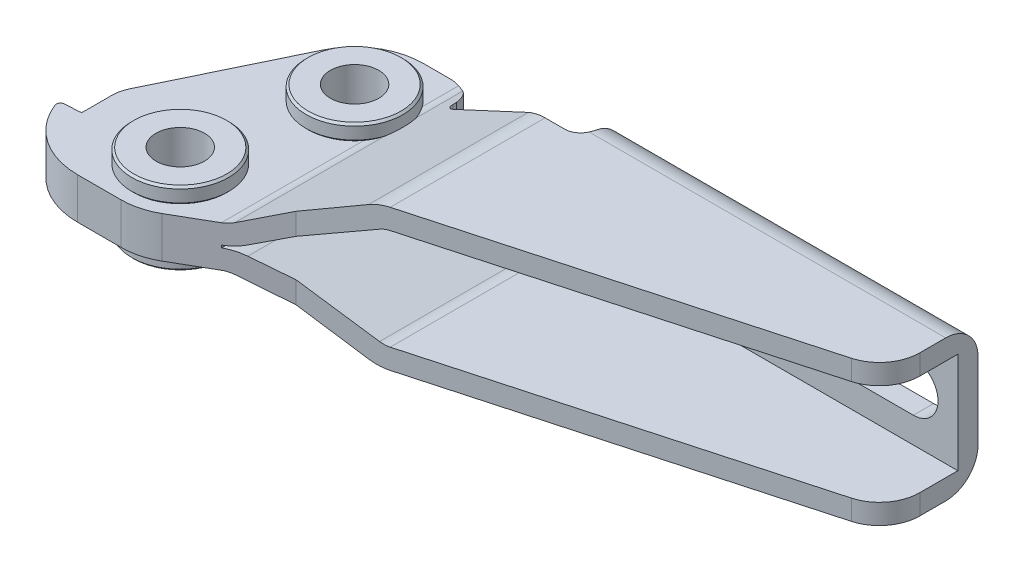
ISO-10303-21;
HEADER;
FILE_DESCRIPTION(('STEP AP214'),'2;1');
FILE_NAME('part.step','',(''),(''),'','','');
FILE_SCHEMA(('AUTOMOTIVE_DESIGN { 1 0 10303 214 1 1 1 1 }'));
ENDSEC;
DATA;
#1=APPLICATION_CONTEXT('core data for automotive mechanical design processes');
#2=APPLICATION_PROTOCOL_DEFINITION('international standard','automotive_design',2000,#1);
#3=PRODUCT_CONTEXT('',#1,'mechanical');
#4=PRODUCT('Part','Part','',(#3));
#5=PRODUCT_RELATED_PRODUCT_CATEGORY('part','',(#4));
#6=PRODUCT_DEFINITION_FORMATION('','',#4);
#7=PRODUCT_DEFINITION_CONTEXT('part definition',#1,'design');
#8=PRODUCT_DEFINITION('design','',#6,#7);
#9=PRODUCT_DEFINITION_SHAPE('','',#8);
#10=(LENGTH_UNIT() NAMED_UNIT(*) SI_UNIT(.MILLI.,.METRE.));
#11=(NAMED_UNIT(*) PLANE_ANGLE_UNIT() SI_UNIT($,.RADIAN.));
#12=(NAMED_UNIT(*) SI_UNIT($,.STERADIAN.) SOLID_ANGLE_UNIT());
#13=UNCERTAINTY_MEASURE_WITH_UNIT(LENGTH_MEASURE(1.E-05),#10,'distance_accuracy_value','');
#14=(GEOMETRIC_REPRESENTATION_CONTEXT(3) GLOBAL_UNCERTAINTY_ASSIGNED_CONTEXT((#13)) GLOBAL_UNIT_ASSIGNED_CONTEXT((#10,
#11,#12)) REPRESENTATION_CONTEXT('',''));
#15=CARTESIAN_POINT('',(0.,0.,0.));
#16=DIRECTION('',(0.,0.,1.));
#17=DIRECTION('',(1.,0.,0.));
#18=AXIS2_PLACEMENT_3D('',#15,#16,#17);
#19=CARTESIAN_POINT('',(4.6,0.15,26.63));
#20=DIRECTION('',(1.,0.,0.));
#21=DIRECTION('',(0.,1.,0.));
#22=AXIS2_PLACEMENT_3D('',#19,#20,#21);
#23=PLANE('',#22);
#24=DIRECTION('',(0.,-1.,0.));
#25=VECTOR('',#24,1.);
#26=CARTESIAN_POINT('',(4.6,19.4610135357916,2.47174997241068));
#27=LINE('',#26,#25);
#28=CARTESIAN_POINT('',(4.6,0.15,2.47174997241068));
#29=VERTEX_POINT('',#28);
#30=CARTESIAN_POINT('',(4.6,-0.15,2.47174997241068));
#31=VERTEX_POINT('',#30);
#32=EDGE_CURVE('E29',#29,#31,#27,.T.);
#33=ORIENTED_EDGE('',*,*,#32,.F.);
#34=DIRECTION('',(0.,0.,-1.));
#35=VECTOR('',#34,1.);
#36=CARTESIAN_POINT('',(4.6,0.15,26.63));
#37=LINE('',#36,#35);
#38=CARTESIAN_POINT('',(4.6,0.15,21.0935244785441));
#39=VERTEX_POINT('',#38);
#40=EDGE_CURVE('E417',#39,#29,#37,.T.);
#41=ORIENTED_EDGE('',*,*,#40,.F.);
#42=DIRECTION('',(0.,1.,0.));
#43=VECTOR('',#42,1.);
#44=CARTESIAN_POINT('',(4.6,-8.75,21.0935244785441));
#45=LINE('',#44,#43);
#46=CARTESIAN_POINT('',(4.6,-0.15,21.0935244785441));
#47=VERTEX_POINT('',#46);
#48=EDGE_CURVE('E829',#47,#39,#45,.T.);
#49=ORIENTED_EDGE('',*,*,#48,.F.);
#50=DIRECTION('',(0.,0.,-1.));
#51=VECTOR('',#50,1.);
#52=CARTESIAN_POINT('',(4.6,-0.149999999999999,26.63));
#53=LINE('',#52,#51);
#54=EDGE_CURVE('E418',#47,#31,#53,.T.);
#55=ORIENTED_EDGE('',*,*,#54,.T.);
#56=EDGE_LOOP('',(#33,#41,#49,#55));
#57=FACE_BOUND('',#56,.T.);
#58=ADVANCED_FACE('F14',(#57),#23,.T.);
#59=CARTESIAN_POINT('',(0.,-4.55,0.));
#60=DIRECTION('',(0.,1.,0.));
#61=DIRECTION('',(0.752414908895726,0.,0.658689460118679));
#62=AXIS2_PLACEMENT_3D('',#59,#60,#61);
#63=CYLINDRICAL_SURFACE('',#62,6.);
#64=CARTESIAN_POINT('',(0.,0.15575268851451,0.));
#65=DIRECTION('',(-0.421404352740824,0.906872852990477,0.));
#66=DIRECTION('',(0.906872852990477,0.421404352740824,0.));
#67=AXIS2_PLACEMENT_3D('',#64,#65,#66);
#68=ELLIPSE('',#67,6.61614247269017,6.);
#69=CARTESIAN_POINT('',(5.69048726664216,2.8,-1.90219732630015));
#70=VERTEX_POINT('',#69);
#71=CARTESIAN_POINT('',(5.69048726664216,2.8,1.90219732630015));
#72=VERTEX_POINT('',#71);
#73=EDGE_CURVE('E1034',#70,#72,#68,.F.);
#74=ORIENTED_EDGE('',*,*,#73,.F.);
#75=CARTESIAN_POINT('',(0.,2.8,0.));
#76=DIRECTION('',(0.,1.,0.));
#77=DIRECTION('',(0.752414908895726,0.,0.658689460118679));
#78=AXIS2_PLACEMENT_3D('',#75,#76,#77);
#79=CIRCLE('',#78,6.);
#80=EDGE_CURVE('E1095',#70,#72,#79,.T.);
#81=ORIENTED_EDGE('',*,*,#80,.T.);
#82=EDGE_LOOP('',(#74,#81));
#83=FACE_BOUND('',#82,.T.);
#84=CARTESIAN_POINT('',(0.,4.3,0.));
#85=DIRECTION('',(0.,1.,0.));
#86=DIRECTION('',(0.752414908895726,0.,0.658689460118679));
#87=AXIS2_PLACEMENT_3D('',#84,#85,#86);
#88=CIRCLE('',#87,6.);
#89=CARTESIAN_POINT('',(4.51448945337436,4.3,3.95213676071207));
#90=VERTEX_POINT('',#89);
#91=EDGE_CURVE('E1061',#90,#90,#88,.T.);
#92=ORIENTED_EDGE('',*,*,#91,.F.);
#93=EDGE_LOOP('',(#92));
#94=FACE_BOUND('',#93,.T.);
#95=ADVANCED_FACE('F469',(#83,#94),#63,.T.);
#96=CARTESIAN_POINT('',(0.,2.55,0.));
#97=DIRECTION('',(0.,1.,0.));
#98=DIRECTION('',(0.752414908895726,0.,0.658689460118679));
#99=AXIS2_PLACEMENT_3D('',#96,#97,#98);
#100=CONICAL_SURFACE('',#99,5.75,0.785398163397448);
#101=CARTESIAN_POINT('',(5.74029161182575,2.8252,1.8308706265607));
#102=CARTESIAN_POINT('',(5.69062976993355,2.79978605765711,1.902985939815));
#103=CARTESIAN_POINT('',(5.64102169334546,2.7764202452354,1.97582976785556));
#104=CARTESIAN_POINT('',(5.54150013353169,2.73341557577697,2.12238873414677));
#105=CARTESIAN_POINT('',(5.49158670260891,2.7137760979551,2.19610372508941));
#106=CARTESIAN_POINT('',(5.39131483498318,2.67795004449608,2.34341823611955));
#107=CARTESIAN_POINT('',(5.34096061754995,2.66174423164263,2.41701597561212));
#108=CARTESIAN_POINT('',(5.23939214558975,2.63256890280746,2.56425846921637));
#109=CARTESIAN_POINT('',(5.18817783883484,2.61959958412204,2.63790322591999));
#110=CARTESIAN_POINT('',(5.0331388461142,2.58553446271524,2.85861551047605));
#111=CARTESIAN_POINT('',(4.92790048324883,2.56927519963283,3.00548715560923));
#112=CARTESIAN_POINT('',(4.76734456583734,2.55502522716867,3.22506243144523));
#113=CARTESIAN_POINT('',(4.71321385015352,2.55197112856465,3.29834545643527));
#114=CARTESIAN_POINT('',(4.60428961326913,2.54940976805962,3.44449457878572));
#115=CARTESIAN_POINT('',(4.54949600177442,2.54990299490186,3.51736061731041));
#116=CARTESIAN_POINT('',(4.49444891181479,2.5522292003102,3.58999578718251));
#117=B_SPLINE_CURVE_WITH_KNOTS('',3,(#101,#102,#103,#104,#105,#106,#107,#108,#109,#110,#111,
#112,#113,#114,#115,#116),.UNSPECIFIED.,.F.,.F.,(4,2,2,2,2,2,2,4),(0.,0.273462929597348,
0.546880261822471,0.818722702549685,1.09058171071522,1.63420362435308,1.90761902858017,
2.18107210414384),.UNSPECIFIED.);
#118=CARTESIAN_POINT('',(5.6535108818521,2.7828178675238,1.95753016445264));
#119=VERTEX_POINT('',#118);
#120=CARTESIAN_POINT('',(4.6,2.55,3.45));
#121=VERTEX_POINT('',#120);
#122=EDGE_CURVE('E700',#119,#121,#117,.T.);
#123=ORIENTED_EDGE('',*,*,#122,.F.);
#124=CARTESIAN_POINT('',(1.98877471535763,1.07989361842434,0.));
#125=DIRECTION('',(-0.421404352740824,0.906872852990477,0.));
#126=DIRECTION('',(0.906872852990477,0.421404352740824,0.));
#127=AXIS2_PLACEMENT_3D('',#124,#125,#126);
#128=ELLIPSE('',#127,4.71939765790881,3.78975784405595);
#129=EDGE_CURVE('E701',#72,#119,#128,.F.);
#130=ORIENTED_EDGE('',*,*,#129,.F.);
#131=ORIENTED_EDGE('',*,*,#80,.F.);
#132=CARTESIAN_POINT('',(5.6535108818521,2.7828178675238,-1.95753016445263));
#133=VERTEX_POINT('',#132);
#134=EDGE_CURVE('E1036',#133,#70,#128,.F.);
#135=ORIENTED_EDGE('',*,*,#134,.F.);
#136=CARTESIAN_POINT('',(4.49444891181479,2.5522292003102,-3.58999578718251));
#137=CARTESIAN_POINT('',(4.54949600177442,2.54990299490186,-3.51736061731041));
#138=CARTESIAN_POINT('',(4.60428961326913,2.54940976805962,-3.44449457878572));
#139=CARTESIAN_POINT('',(4.71321385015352,2.55197112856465,-3.29834545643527));
#140=CARTESIAN_POINT('',(4.76734456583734,2.55502522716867,-3.22506243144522));
#141=CARTESIAN_POINT('',(4.92790048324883,2.56927519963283,-3.00548715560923));
#142=CARTESIAN_POINT('',(5.0331388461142,2.58553446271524,-2.85861551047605));
#143=CARTESIAN_POINT('',(5.18817783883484,2.61959958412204,-2.63790322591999));
#144=CARTESIAN_POINT('',(5.23939214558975,2.63256890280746,-2.56425846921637));
#145=CARTESIAN_POINT('',(5.34096061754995,2.66174423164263,-2.41701597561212));
#146=CARTESIAN_POINT('',(5.39131483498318,2.67795004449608,-2.34341823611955));
#147=CARTESIAN_POINT('',(5.49158670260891,2.7137760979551,-2.19610372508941));
#148=CARTESIAN_POINT('',(5.54150013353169,2.73341557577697,-2.12238873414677));
#149=CARTESIAN_POINT('',(5.64102169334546,2.7764202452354,-1.97582976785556));
#150=CARTESIAN_POINT('',(5.69062976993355,2.79978605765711,-1.902985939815));
#151=CARTESIAN_POINT('',(5.74029161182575,2.8252,-1.8308706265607));
#152=B_SPLINE_CURVE_WITH_KNOTS('',3,(#136,#137,#138,#139,#140,#141,#142,#143,#144,#145,#146,
#147,#148,#149,#150,#151),.UNSPECIFIED.,.F.,.F.,(4,2,2,2,2,2,2,4),(0.,0.273453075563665,
0.54686847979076,1.09049039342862,1.36234940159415,1.63419184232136,1.90760917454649,
2.18107210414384),.UNSPECIFIED.);
#153=CARTESIAN_POINT('',(4.6,2.55,-3.45));
#154=VERTEX_POINT('',#153);
#155=EDGE_CURVE('E692',#154,#133,#152,.T.);
#156=ORIENTED_EDGE('',*,*,#155,.F.);
#157=CARTESIAN_POINT('',(0.,2.55,0.));
#158=DIRECTION('',(0.,1.,0.));
#159=DIRECTION('',(0.,0.,-1.));
#160=AXIS2_PLACEMENT_3D('',#157,#158,#159);
#161=CIRCLE('',#160,5.75);
#162=EDGE_CURVE('E785',#121,#154,#161,.F.);
#163=ORIENTED_EDGE('',*,*,#162,.F.);
#164=EDGE_LOOP('',(#123,#130,#131,#135,#156,#163));
#165=FACE_BOUND('',#164,.T.);
#166=ADVANCED_FACE('F709',(#165),#100,.T.);
#167=CARTESIAN_POINT('',(0.,4.3,0.));
#168=DIRECTION('',(0.,-1.,0.));
#169=DIRECTION('',(-0.752414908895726,0.,-0.658689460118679));
#170=AXIS2_PLACEMENT_3D('',#167,#168,#169);
#171=CONICAL_SURFACE('',#170,6.,0.785398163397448);
#172=CARTESIAN_POINT('',(0.,4.55,0.));
#173=DIRECTION('',(0.,1.,0.));
#174=DIRECTION('',(0.752414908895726,0.,0.658689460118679));
#175=AXIS2_PLACEMENT_3D('',#172,#173,#174);
#176=CIRCLE('',#175,5.75);
#177=CARTESIAN_POINT('',(4.32638572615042,4.55,3.7874643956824));
#178=VERTEX_POINT('',#177);
#179=EDGE_CURVE('E1058',#178,#178,#176,.T.);
#180=ORIENTED_EDGE('',*,*,#179,.F.);
#181=EDGE_LOOP('',(#180));
#182=FACE_BOUND('',#181,.T.);
#183=ORIENTED_EDGE('',*,*,#91,.T.);
#184=EDGE_LOOP('',(#183));
#185=FACE_BOUND('',#184,.T.);
#186=ADVANCED_FACE('F714',(#182,#185),#171,.T.);
#187=CARTESIAN_POINT('',(3.78746439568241,4.55,-4.32638572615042));
#188=DIRECTION('',(0.,-1.,0.));
#189=DIRECTION('',(-0.752414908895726,0.,-0.658689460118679));
#190=AXIS2_PLACEMENT_3D('',#187,#188,#189);
#191=PLANE('',#190);
#192=ORIENTED_EDGE('',*,*,#179,.T.);
#193=EDGE_LOOP('',(#192));
#194=FACE_BOUND('',#193,.T.);
#195=CARTESIAN_POINT('',(0.,4.55,0.));
#196=DIRECTION('',(0.,1.,0.));
#197=DIRECTION('',(0.752414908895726,0.,0.658689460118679));
#198=AXIS2_PLACEMENT_3D('',#195,#196,#197);
#199=CIRCLE('',#198,3.);
#200=CARTESIAN_POINT('',(2.25724472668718,4.55,1.97606838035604));
#201=VERTEX_POINT('',#200);
#202=EDGE_CURVE('E1067',#201,#201,#199,.T.);
#203=ORIENTED_EDGE('',*,*,#202,.F.);
#204=EDGE_LOOP('',(#203));
#205=FACE_BOUND('',#204,.T.);
#206=ADVANCED_FACE('F722',(#194,#205),#191,.F.);
#207=CARTESIAN_POINT('',(0.,-4.55,0.));
#208=DIRECTION('',(0.,1.,0.));
#209=DIRECTION('',(0.752414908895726,0.,0.658689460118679));
#210=AXIS2_PLACEMENT_3D('',#207,#208,#209);
#211=CYLINDRICAL_SURFACE('',#210,3.);
#212=CARTESIAN_POINT('',(0.,-4.55,0.));
#213=DIRECTION('',(0.,1.,0.));
#214=DIRECTION('',(-1.,0.,0.));
#215=AXIS2_PLACEMENT_3D('',#212,#213,#214);
#216=CIRCLE('',#215,3.);
#217=CARTESIAN_POINT('',(-3.,-4.55,0.));
#218=VERTEX_POINT('',#217);
#219=EDGE_CURVE('E832',#218,#218,#216,.F.);
#220=ORIENTED_EDGE('',*,*,#219,.T.);
#221=EDGE_LOOP('',(#220));
#222=FACE_BOUND('',#221,.T.);
#223=ORIENTED_EDGE('',*,*,#202,.T.);
#224=EDGE_LOOP('',(#223));
#225=FACE_BOUND('',#224,.T.);
#226=ADVANCED_FACE('F717',(#222,#225),#211,.F.);
#227=CARTESIAN_POINT('',(-4.05,-2.55,17.54));
#228=DIRECTION('',(0.,-1.,0.));
#229=DIRECTION('',(-0.752414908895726,0.,-0.658689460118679));
#230=AXIS2_PLACEMENT_3D('',#227,#228,#229);
#231=CONICAL_SURFACE('',#230,5.8,0.785398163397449);
#232=CARTESIAN_POINT('',(-4.05,-2.75,17.54));
#233=DIRECTION('',(0.,-1.,0.));
#234=DIRECTION('',(-0.752414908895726,0.,-0.658689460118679));
#235=AXIS2_PLACEMENT_3D('',#232,#233,#234);
#236=CIRCLE('',#235,6.);
#237=CARTESIAN_POINT('',(-8.56448945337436,-2.75,13.5878632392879));
#238=VERTEX_POINT('',#237);
#239=EDGE_CURVE('E854',#238,#238,#236,.T.);
#240=ORIENTED_EDGE('',*,*,#239,.F.);
#241=EDGE_LOOP('',(#240));
#242=FACE_BOUND('',#241,.T.);
#243=CARTESIAN_POINT('',(-4.05,-2.55,17.54));
#244=DIRECTION('',(0.,-1.,0.));
#245=DIRECTION('',(0.,0.,1.));
#246=AXIS2_PLACEMENT_3D('',#243,#244,#245);
#247=CIRCLE('',#246,5.8);
#248=CARTESIAN_POINT('',(-4.05,-2.55,23.34));
#249=VERTEX_POINT('',#248);
#250=EDGE_CURVE('E1040',#249,#249,#247,.F.);
#251=ORIENTED_EDGE('',*,*,#250,.F.);
#252=EDGE_LOOP('',(#251));
#253=FACE_BOUND('',#252,.T.);
#254=ADVANCED_FACE('F721',(#242,#253),#231,.T.);
#255=CARTESIAN_POINT('',(-4.05,-2.55,17.54));
#256=DIRECTION('',(0.,-1.,0.));
#257=DIRECTION('',(-0.752414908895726,0.,-0.658689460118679));
#258=AXIS2_PLACEMENT_3D('',#255,#256,#257);
#259=CYLINDRICAL_SURFACE('',#258,6.);
#260=CARTESIAN_POINT('',(-4.05,-4.3,17.54));
#261=DIRECTION('',(0.,1.,0.));
#262=DIRECTION('',(-1.,0.,0.));
#263=AXIS2_PLACEMENT_3D('',#260,#261,#262);
#264=CIRCLE('',#263,6.);
#265=CARTESIAN_POINT('',(-10.05,-4.3,17.54));
#266=VERTEX_POINT('',#265);
#267=EDGE_CURVE('E781',#266,#266,#264,.T.);
#268=ORIENTED_EDGE('',*,*,#267,.T.);
#269=EDGE_LOOP('',(#268));
#270=FACE_BOUND('',#269,.T.);
#271=ORIENTED_EDGE('',*,*,#239,.T.);
#272=EDGE_LOOP('',(#271));
#273=FACE_BOUND('',#272,.T.);
#274=ADVANCED_FACE('F456',(#270,#273),#259,.T.);
#275=CARTESIAN_POINT('',(-4.05,2.55,17.54));
#276=DIRECTION('',(0.,1.,0.));
#277=DIRECTION('',(0.752414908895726,0.,0.658689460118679));
#278=AXIS2_PLACEMENT_3D('',#275,#276,#277);
#279=CONICAL_SURFACE('',#278,5.75,0.785398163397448);
#280=CARTESIAN_POINT('',(-4.05,2.8,17.54));
#281=DIRECTION('',(0.,1.,0.));
#282=DIRECTION('',(0.752414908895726,0.,0.658689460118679));
#283=AXIS2_PLACEMENT_3D('',#280,#281,#282);
#284=CIRCLE('',#283,6.);
#285=CARTESIAN_POINT('',(0.464489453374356,2.8,21.4921367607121));
#286=VERTEX_POINT('',#285);
#287=EDGE_CURVE('E1064',#286,#286,#284,.T.);
#288=ORIENTED_EDGE('',*,*,#287,.F.);
#289=EDGE_LOOP('',(#288));
#290=FACE_BOUND('',#289,.T.);
#291=CARTESIAN_POINT('',(-4.05,2.55,17.54));
#292=DIRECTION('',(0.,1.,0.));
#293=DIRECTION('',(0.,0.,-1.));
#294=AXIS2_PLACEMENT_3D('',#291,#292,#293);
#295=CIRCLE('',#294,5.75);
#296=CARTESIAN_POINT('',(-4.05,2.55,11.79));
#297=VERTEX_POINT('',#296);
#298=EDGE_CURVE('E753',#297,#297,#295,.F.);
#299=ORIENTED_EDGE('',*,*,#298,.F.);
#300=EDGE_LOOP('',(#299));
#301=FACE_BOUND('',#300,.T.);
#302=ADVANCED_FACE('F1078',(#290,#301),#279,.T.);
#303=CARTESIAN_POINT('',(-4.05,-4.55,17.54));
#304=DIRECTION('',(0.,1.,0.));
#305=DIRECTION('',(0.752414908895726,0.,0.658689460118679));
#306=AXIS2_PLACEMENT_3D('',#303,#304,#305);
#307=CYLINDRICAL_SURFACE('',#306,6.);
#308=CARTESIAN_POINT('',(-4.05,4.3,17.54));
#309=DIRECTION('',(0.,1.,0.));
#310=DIRECTION('',(0.752414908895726,0.,0.658689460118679));
#311=AXIS2_PLACEMENT_3D('',#308,#309,#310);
#312=CIRCLE('',#311,6.);
#313=CARTESIAN_POINT('',(0.464489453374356,4.3,21.4921367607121));
#314=VERTEX_POINT('',#313);
#315=EDGE_CURVE('E1071',#314,#314,#312,.T.);
#316=ORIENTED_EDGE('',*,*,#315,.F.);
#317=EDGE_LOOP('',(#316));
#318=FACE_BOUND('',#317,.T.);
#319=ORIENTED_EDGE('',*,*,#287,.T.);
#320=EDGE_LOOP('',(#319));
#321=FACE_BOUND('',#320,.T.);
#322=ADVANCED_FACE('F1076',(#318,#321),#307,.T.);
#323=CARTESIAN_POINT('',(-4.05,4.3,17.54));
#324=DIRECTION('',(0.,-1.,0.));
#325=DIRECTION('',(-0.752414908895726,0.,-0.658689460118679));
#326=AXIS2_PLACEMENT_3D('',#323,#324,#325);
#327=CONICAL_SURFACE('',#326,6.,0.785398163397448);
#328=CARTESIAN_POINT('',(-4.05,4.55,17.54));
#329=DIRECTION('',(0.,1.,0.));
#330=DIRECTION('',(0.752414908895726,0.,0.658689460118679));
#331=AXIS2_PLACEMENT_3D('',#328,#329,#330);
#332=CIRCLE('',#331,5.75);
#333=CARTESIAN_POINT('',(0.276385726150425,4.55,21.3274643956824));
#334=VERTEX_POINT('',#333);
#335=EDGE_CURVE('E837',#334,#334,#332,.T.);
#336=ORIENTED_EDGE('',*,*,#335,.F.);
#337=EDGE_LOOP('',(#336));
#338=FACE_BOUND('',#337,.T.);
#339=ORIENTED_EDGE('',*,*,#315,.T.);
#340=EDGE_LOOP('',(#339));
#341=FACE_BOUND('',#340,.T.);
#342=ADVANCED_FACE('F1406',(#338,#341),#327,.T.);
#343=CARTESIAN_POINT('',(-0.262535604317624,4.55,13.2136142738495));
#344=DIRECTION('',(0.,-1.,0.));
#345=DIRECTION('',(-0.752414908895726,0.,-0.658689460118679));
#346=AXIS2_PLACEMENT_3D('',#343,#344,#345);
#347=PLANE('',#346);
#348=ORIENTED_EDGE('',*,*,#335,.T.);
#349=EDGE_LOOP('',(#348));
#350=FACE_BOUND('',#349,.T.);
#351=CARTESIAN_POINT('',(-4.05,4.55,17.54));
#352=DIRECTION('',(0.,1.,0.));
#353=DIRECTION('',(0.752414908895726,0.,0.658689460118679));
#354=AXIS2_PLACEMENT_3D('',#351,#352,#353);
#355=CIRCLE('',#354,3.);
#356=CARTESIAN_POINT('',(-1.79275527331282,4.55,19.516068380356));
#357=VERTEX_POINT('',#356);
#358=EDGE_CURVE('E702',#357,#357,#355,.T.);
#359=ORIENTED_EDGE('',*,*,#358,.F.);
#360=EDGE_LOOP('',(#359));
#361=FACE_BOUND('',#360,.T.);
#362=ADVANCED_FACE('F1464',(#350,#361),#347,.F.);
#363=CARTESIAN_POINT('',(-4.05,-4.55,17.54));
#364=DIRECTION('',(0.,1.,0.));
#365=DIRECTION('',(0.752414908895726,0.,0.658689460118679));
#366=AXIS2_PLACEMENT_3D('',#363,#364,#365);
#367=CYLINDRICAL_SURFACE('',#366,3.);
#368=CARTESIAN_POINT('',(-4.05,-4.55,17.54));
#369=DIRECTION('',(0.,1.,0.));
#370=DIRECTION('',(-1.,0.,0.));
#371=AXIS2_PLACEMENT_3D('',#368,#369,#370);
#372=CIRCLE('',#371,3.);
#373=CARTESIAN_POINT('',(-7.05,-4.55,17.54));
#374=VERTEX_POINT('',#373);
#375=EDGE_CURVE('E830',#374,#374,#372,.F.);
#376=ORIENTED_EDGE('',*,*,#375,.T.);
#377=EDGE_LOOP('',(#376));
#378=FACE_BOUND('',#377,.T.);
#379=ORIENTED_EDGE('',*,*,#358,.T.);
#380=EDGE_LOOP('',(#379));
#381=FACE_BOUND('',#380,.T.);
#382=ADVANCED_FACE('F1082',(#378,#381),#367,.F.);
#383=CARTESIAN_POINT('',(0.,-2.55,0.));
#384=DIRECTION('',(0.,-1.,0.));
#385=DIRECTION('',(-0.752414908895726,0.,-0.658689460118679));
#386=AXIS2_PLACEMENT_3D('',#383,#384,#385);
#387=CONICAL_SURFACE('',#386,5.8,0.785398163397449);
#388=CARTESIAN_POINT('',(5.62592005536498,-2.7702,-2.14285593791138));
#389=CARTESIAN_POINT('',(5.58008392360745,-2.74959539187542,-2.20533202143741));
#390=CARTESIAN_POINT('',(5.5342834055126,-2.73062552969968,-2.26835489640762));
#391=CARTESIAN_POINT('',(5.44251087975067,-2.6957247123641,-2.39510061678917));
#392=CARTESIAN_POINT('',(5.39653889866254,-2.67979330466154,-2.45882335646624));
#393=CARTESIAN_POINT('',(5.3043943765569,-2.65080427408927,-2.58627983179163));
#394=CARTESIAN_POINT('',(5.2582239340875,-2.6377329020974,-2.65001197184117));
#395=CARTESIAN_POINT('',(5.16536687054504,-2.61429581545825,-2.77759649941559));
#396=CARTESIAN_POINT('',(5.11868022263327,-2.60393024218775,-2.84144889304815));
#397=CARTESIAN_POINT('',(4.97777456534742,-2.5768565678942,-3.03294805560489));
#398=CARTESIAN_POINT('',(4.88269090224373,-2.56416556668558,-3.1605632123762));
#399=CARTESIAN_POINT('',(4.73836648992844,-2.55336359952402,-3.35161589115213));
#400=CARTESIAN_POINT('',(4.68984998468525,-2.55114027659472,-3.4153997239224));
#401=CARTESIAN_POINT('',(4.59242234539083,-2.54953664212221,-3.54269810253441));
#402=CARTESIAN_POINT('',(4.54351122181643,-2.55015625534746,-3.60621265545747));
#403=CARTESIAN_POINT('',(4.49444891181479,-2.5522292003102,-3.66957663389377));
#404=B_SPLINE_CURVE_WITH_KNOTS('',3,(#388,#389,#390,#391,#392,#393,#394,#395,#396,#397,#398,
#399,#400,#401,#402,#403),.UNSPECIFIED.,.F.,.F.,(4,2,2,2,2,2,2,4),(0.,0.240499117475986,
0.480962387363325,0.720242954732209,0.959536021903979,1.43802324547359,1.67848964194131,
1.91894967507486),.UNSPECIFIED.);
#405=CARTESIAN_POINT('',(5.5797958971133,-2.75,-2.20587346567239));
#406=VERTEX_POINT('',#405);
#407=CARTESIAN_POINT('',(4.6,-2.55,-3.53270434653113));
#408=VERTEX_POINT('',#407);
#409=EDGE_CURVE('E751',#406,#408,#404,.T.);
#410=ORIENTED_EDGE('',*,*,#409,.F.);
#411=CARTESIAN_POINT('',(0.,-2.75,0.));
#412=DIRECTION('',(0.,-1.,0.));
#413=DIRECTION('',(-0.752414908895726,0.,-0.658689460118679));
#414=AXIS2_PLACEMENT_3D('',#411,#412,#413);
#415=CIRCLE('',#414,6.);
#416=CARTESIAN_POINT('',(5.5797958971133,-2.75,2.20587346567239));
#417=VERTEX_POINT('',#416);
#418=EDGE_CURVE('E1055',#417,#406,#415,.T.);
#419=ORIENTED_EDGE('',*,*,#418,.F.);
#420=CARTESIAN_POINT('',(4.49444891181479,-2.5522292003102,3.66957663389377));
#421=CARTESIAN_POINT('',(4.54351122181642,-2.55015625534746,3.60621265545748));
#422=CARTESIAN_POINT('',(4.59242234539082,-2.54953664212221,3.54269810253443));
#423=CARTESIAN_POINT('',(4.68984998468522,-2.55114027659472,3.41539972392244));
#424=CARTESIAN_POINT('',(4.73836648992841,-2.55336359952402,3.35161589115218));
#425=CARTESIAN_POINT('',(4.88269090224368,-2.56416556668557,3.16056321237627));
#426=CARTESIAN_POINT('',(4.97777456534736,-2.57685656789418,3.03294805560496));
#427=CARTESIAN_POINT('',(5.11868022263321,-2.60393024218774,2.84144889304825));
#428=CARTESIAN_POINT('',(5.16536687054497,-2.61429581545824,2.7775964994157));
#429=CARTESIAN_POINT('',(5.2582239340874,-2.63773290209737,2.65001197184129));
#430=CARTESIAN_POINT('',(5.30439437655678,-2.65080427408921,2.58627983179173));
#431=CARTESIAN_POINT('',(5.39653889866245,-2.67979330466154,2.45882335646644));
#432=CARTESIAN_POINT('',(5.44251087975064,-2.69572471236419,2.39510061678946));
#433=CARTESIAN_POINT('',(5.53428340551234,-2.73062552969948,2.26835489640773));
#434=CARTESIAN_POINT('',(5.58008392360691,-2.74959539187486,2.20533202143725));
#435=CARTESIAN_POINT('',(5.62592005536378,-2.77019999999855,2.14285593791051));
#436=B_SPLINE_CURVE_WITH_KNOTS('',3,(#420,#421,#422,#423,#424,#425,#426,#427,#428,#429,#430,
#431,#432,#433,#434,#435),.UNSPECIFIED.,.F.,.F.,(4,2,2,2,2,2,2,4),(0.,0.240460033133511,
0.480926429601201,0.959413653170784,1.19870672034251,1.43798728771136,1.67845055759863,
1.91894967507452),.UNSPECIFIED.);
#437=CARTESIAN_POINT('',(4.6,-2.55,3.53270434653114));
#438=VERTEX_POINT('',#437);
#439=EDGE_CURVE('E752',#438,#417,#436,.T.);
#440=ORIENTED_EDGE('',*,*,#439,.F.);
#441=CARTESIAN_POINT('',(0.,-2.55,0.));
#442=DIRECTION('',(0.,-1.,0.));
#443=DIRECTION('',(0.,0.,1.));
#444=AXIS2_PLACEMENT_3D('',#441,#442,#443);
#445=CIRCLE('',#444,5.8);
#446=EDGE_CURVE('E1039',#408,#438,#445,.F.);
#447=ORIENTED_EDGE('',*,*,#446,.F.);
#448=EDGE_LOOP('',(#410,#419,#440,#447));
#449=FACE_BOUND('',#448,.T.);
#450=ADVANCED_FACE('F724',(#449),#387,.T.);
#451=CARTESIAN_POINT('',(0.,-2.55,0.));
#452=DIRECTION('',(0.,-1.,0.));
#453=DIRECTION('',(-0.752414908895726,0.,-0.658689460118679));
#454=AXIS2_PLACEMENT_3D('',#451,#452,#453);
#455=CYLINDRICAL_SURFACE('',#454,6.);
#456=CARTESIAN_POINT('',(0.,-4.3,0.));
#457=DIRECTION('',(0.,1.,0.));
#458=DIRECTION('',(0.,0.,-1.));
#459=AXIS2_PLACEMENT_3D('',#456,#457,#458);
#460=CIRCLE('',#459,6.);
#461=CARTESIAN_POINT('',(0.,-4.3,-6.));
#462=VERTEX_POINT('',#461);
#463=EDGE_CURVE('E22',#462,#462,#460,.T.);
#464=ORIENTED_EDGE('',*,*,#463,.T.);
#465=EDGE_LOOP('',(#464));
#466=FACE_BOUND('',#465,.T.);
#467=CARTESIAN_POINT('',(5.6535108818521,-2.7828178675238,-2.0094314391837));
#468=CARTESIAN_POINT('',(5.64179662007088,-2.77736519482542,-2.04238909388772));
#469=CARTESIAN_POINT('',(5.6297965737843,-2.77190403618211,-2.07523809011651));
#470=CARTESIAN_POINT('',(5.60522491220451,-2.76096474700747,-2.14071876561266));
#471=CARTESIAN_POINT('',(5.5926532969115,-2.75548661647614,-2.1733504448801));
#472=CARTESIAN_POINT('',(5.57979589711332,-2.74999999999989,-2.20587346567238));
#473=B_SPLINE_CURVE_WITH_KNOTS('',3,(#467,#468,#469,#470,#471,#472),.UNSPECIFIED.,.F.,.F.,(4,2,
4),(0.,0.106188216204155,0.212376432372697),.UNSPECIFIED.);
#474=CARTESIAN_POINT('',(5.6535108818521,-2.7828178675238,-2.0094314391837));
#475=VERTEX_POINT('',#474);
#476=EDGE_CURVE('E745',#475,#406,#473,.T.);
#477=ORIENTED_EDGE('',*,*,#476,.F.);
#478=CARTESIAN_POINT('',(0.,-0.15575268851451,0.));
#479=DIRECTION('',(-0.421404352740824,-0.906872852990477,0.));
#480=DIRECTION('',(0.906872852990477,-0.421404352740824,0.));
#481=AXIS2_PLACEMENT_3D('',#478,#479,#480);
#482=ELLIPSE('',#481,6.61614247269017,6.);
#483=CARTESIAN_POINT('',(5.6535108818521,-2.7828178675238,2.0094314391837));
#484=VERTEX_POINT('',#483);
#485=EDGE_CURVE('E778',#484,#475,#482,.F.);
#486=ORIENTED_EDGE('',*,*,#485,.F.);
#487=CARTESIAN_POINT('',(5.5797958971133,-2.75,2.20587346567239));
#488=CARTESIAN_POINT('',(5.59265329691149,-2.75548661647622,2.17335044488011));
#489=CARTESIAN_POINT('',(5.6052249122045,-2.76096474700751,2.14071876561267));
#490=CARTESIAN_POINT('',(5.6297965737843,-2.77190403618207,2.07523809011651));
#491=CARTESIAN_POINT('',(5.64179662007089,-2.77736519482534,2.04238909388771));
#492=CARTESIAN_POINT('',(5.65351088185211,-2.78281786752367,2.00943143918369));
#493=B_SPLINE_CURVE_WITH_KNOTS('',3,(#487,#488,#489,#490,#491,#492),.UNSPECIFIED.,.F.,.F.,(4,2,
4),(0.,0.106188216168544,0.212376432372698),.UNSPECIFIED.);
#494=EDGE_CURVE('E738',#417,#484,#493,.T.);
#495=ORIENTED_EDGE('',*,*,#494,.F.);
#496=ORIENTED_EDGE('',*,*,#418,.T.);
#497=EDGE_LOOP('',(#477,#486,#495,#496));
#498=FACE_BOUND('',#497,.T.);
#499=ADVANCED_FACE('F728',(#466,#498),#455,.T.);
#500=CARTESIAN_POINT('',(4.6,-2.55,26.84));
#501=DIRECTION('',(0.,-1.,0.));
#502=DIRECTION('',(0.,0.,1.));
#503=AXIS2_PLACEMENT_3D('',#500,#501,#502);
#504=PLANE('',#503);
#505=DIRECTION('',(0.,0.,-1.));
#506=VECTOR('',#505,1.);
#507=CARTESIAN_POINT('',(4.6,-2.55,26.84));
#508=LINE('',#507,#506);
#509=CARTESIAN_POINT('',(4.6,-2.55,-8.2862778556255));
#510=VERTEX_POINT('',#509);
#511=EDGE_CURVE('E1249',#408,#510,#508,.T.);
#512=ORIENTED_EDGE('',*,*,#511,.F.);
#513=ORIENTED_EDGE('',*,*,#446,.T.);
#514=CARTESIAN_POINT('',(4.6,-2.55,21.0935244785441));
#515=VERTEX_POINT('',#514);
#516=EDGE_CURVE('E1051',#515,#438,#508,.T.);
#517=ORIENTED_EDGE('',*,*,#516,.F.);
#518=DIRECTION('',(0.866025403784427,0.,-0.50000000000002));
#519=VECTOR('',#518,1.);
#520=CARTESIAN_POINT('',(-0.0499999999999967,-2.55,23.778203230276));
#521=LINE('',#520,#519);
#522=CARTESIAN_POINT('',(-0.0499999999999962,-2.55,23.778203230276));
#523=VERTEX_POINT('',#522);
#524=EDGE_CURVE('E992',#523,#515,#521,.T.);
#525=ORIENTED_EDGE('',*,*,#524,.F.);
#526=CARTESIAN_POINT('',(-4.04999999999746,-2.55,16.8500000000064));
#527=DIRECTION('',(0.,-1.,0.));
#528=DIRECTION('',(0.,0.,1.));
#529=AXIS2_PLACEMENT_3D('',#526,#527,#528);
#530=CIRCLE('',#529,7.99999999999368);
#531=CARTESIAN_POINT('',(-4.04999999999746,-2.55,24.85));
#532=VERTEX_POINT('',#531);
#533=EDGE_CURVE('E1217',#532,#523,#530,.F.);
#534=ORIENTED_EDGE('',*,*,#533,.F.);
#535=DIRECTION('',(1.,0.,0.));
#536=VECTOR('',#535,1.);
#537=CARTESIAN_POINT('',(-9.45,-2.55,24.85));
#538=LINE('',#537,#536);
#539=CARTESIAN_POINT('',(-9.45,-2.55,24.85));
#540=VERTEX_POINT('',#539);
#541=EDGE_CURVE('E1214',#540,#532,#538,.T.);
#542=ORIENTED_EDGE('',*,*,#541,.F.);
#543=CARTESIAN_POINT('',(-9.45000000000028,-2.55,15.3400000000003));
#544=DIRECTION('',(0.,-1.,0.));
#545=DIRECTION('',(0.,0.,1.));
#546=AXIS2_PLACEMENT_3D('',#543,#544,#545);
#547=CIRCLE('',#546,9.50999999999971);
#548=CARTESIAN_POINT('',(-18.324877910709,-2.55,18.75711019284));
#549=VERTEX_POINT('',#548);
#550=EDGE_CURVE('E1211',#549,#540,#547,.F.);
#551=ORIENTED_EDGE('',*,*,#550,.F.);
#552=CARTESIAN_POINT('',(-17.8582702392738,-2.55,18.5774514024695));
#553=DIRECTION('',(0.,-1.,0.));
#554=DIRECTION('',(0.,0.,1.));
#555=AXIS2_PLACEMENT_3D('',#552,#553,#554);
#556=CIRCLE('',#555,0.499999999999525);
#557=CARTESIAN_POINT('',(-17.887253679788,-2.55,18.078292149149));
#558=VERTEX_POINT('',#557);
#559=EDGE_CURVE('E1208',#558,#549,#556,.F.);
#560=ORIENTED_EDGE('',*,*,#559,.F.);
#561=DIRECTION('',(-0.998318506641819,0.,0.0579668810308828));
#562=VECTOR('',#561,1.);
#563=CARTESIAN_POINT('',(-16.038406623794,-2.55,17.970939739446));
#564=LINE('',#563,#562);
#565=CARTESIAN_POINT('',(-16.038406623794,-2.55,17.970939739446));
#566=VERTEX_POINT('',#565);
#567=EDGE_CURVE('E1205',#566,#558,#564,.T.);
#568=ORIENTED_EDGE('',*,*,#567,.F.);
#569=CARTESIAN_POINT('',(-16.05,-2.55,17.7712760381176));
#570=DIRECTION('',(0.,-1.,0.));
#571=DIRECTION('',(0.,0.,1.));
#572=AXIS2_PLACEMENT_3D('',#569,#570,#571);
#573=CIRCLE('',#572,0.200000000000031);
#574=CARTESIAN_POINT('',(-15.85,-2.55,17.771276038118));
#575=VERTEX_POINT('',#574);
#576=EDGE_CURVE('E1202',#575,#566,#573,.T.);
#577=ORIENTED_EDGE('',*,*,#576,.F.);
#578=DIRECTION('',(0.,0.,1.));
#579=VECTOR('',#578,1.);
#580=CARTESIAN_POINT('',(-15.85,-2.55,14.180755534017));
#581=LINE('',#580,#579);
#582=CARTESIAN_POINT('',(-15.85,-2.55,14.180755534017));
#583=VERTEX_POINT('',#582);
#584=EDGE_CURVE('E1199',#583,#575,#581,.T.);
#585=ORIENTED_EDGE('',*,*,#584,.F.);
#586=CARTESIAN_POINT('',(-11.850000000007,-2.55,14.1807555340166));
#587=DIRECTION('',(0.,-1.,0.));
#588=DIRECTION('',(0.,0.,1.));
#589=AXIS2_PLACEMENT_3D('',#586,#587,#588);
#590=CIRCLE('',#589,3.99999999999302);
#591=CARTESIAN_POINT('',(-15.451578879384,-2.55,12.440459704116));
#592=VERTEX_POINT('',#591);
#593=EDGE_CURVE('E1196',#592,#583,#590,.F.);
#594=ORIENTED_EDGE('',*,*,#593,.F.);
#595=DIRECTION('',(-0.435073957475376,0.,0.900394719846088));
#596=VECTOR('',#595,1.);
#597=CARTESIAN_POINT('',(-7.6533551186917,-2.55,-3.69812863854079));
#598=LINE('',#597,#596);
#599=CARTESIAN_POINT('',(-7.6533551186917,-2.55,-3.69812863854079));
#600=VERTEX_POINT('',#599);
#601=EDGE_CURVE('E1193',#600,#592,#598,.T.);
#602=ORIENTED_EDGE('',*,*,#601,.F.);
#603=CARTESIAN_POINT('',(0.,-2.55,0.));
#604=DIRECTION('',(0.,-1.,0.));
#605=DIRECTION('',(0.,0.,1.));
#606=AXIS2_PLACEMENT_3D('',#603,#604,#605);
#607=CIRCLE('',#606,8.5);
#608=CARTESIAN_POINT('',(0.,-2.55,-8.5));
#609=VERTEX_POINT('',#608);
#610=EDGE_CURVE('E1188',#609,#600,#607,.F.);
#611=ORIENTED_EDGE('',*,*,#610,.F.);
#612=DIRECTION('',(-1.,0.,0.));
#613=VECTOR('',#612,1.);
#614=CARTESIAN_POINT('',(3.31,-2.55,-8.5));
#615=LINE('',#614,#613);
#616=CARTESIAN_POINT('',(3.31,-2.55,-8.5));
#617=VERTEX_POINT('',#616);
#618=EDGE_CURVE('E1184',#617,#609,#615,.T.);
#619=ORIENTED_EDGE('',*,*,#618,.F.);
#620=CARTESIAN_POINT('',(3.31000000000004,-2.55,-4.5));
#621=DIRECTION('',(0.,-1.,0.));
#622=DIRECTION('',(0.,0.,1.));
#623=AXIS2_PLACEMENT_3D('',#620,#621,#622);
#624=CIRCLE('',#623,4.);
#625=EDGE_CURVE('E1180',#510,#617,#624,.F.);
#626=ORIENTED_EDGE('',*,*,#625,.F.);
#627=EDGE_LOOP('',(#512,#513,#517,#525,#534,#542,#551,#560,#568,#577,#585,#594,#602,#611,#619,#626));
#628=FACE_BOUND('',#627,.T.);
#629=ORIENTED_EDGE('',*,*,#250,.T.);
#630=EDGE_LOOP('',(#629));
#631=FACE_BOUND('',#630,.T.);
#632=ADVANCED_FACE('F732',(#628,#631),#504,.T.);
#633=CARTESIAN_POINT('',(4.59999999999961,-5.05000000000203,26.84));
#634=DIRECTION('',(0.,0.,-1.));
#635=DIRECTION('',(0.,-1.,0.));
#636=AXIS2_PLACEMENT_3D('',#633,#634,#635);
#637=CYLINDRICAL_SURFACE('',#636,2.50000000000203);
#638=ORIENTED_EDGE('',*,*,#476,.T.);
#639=ORIENTED_EDGE('',*,*,#409,.T.);
#640=ORIENTED_EDGE('',*,*,#511,.T.);
#641=CARTESIAN_POINT('',(5.6535108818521,-2.7828178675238,-7.74159786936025));
#642=CARTESIAN_POINT('',(5.59685152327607,-2.75648848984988,-7.78256797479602));
#643=CARTESIAN_POINT('',(5.53852954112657,-2.73197173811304,-7.8224614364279));
#644=CARTESIAN_POINT('',(5.41864799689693,-2.68696779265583,-7.89980685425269));
#645=CARTESIAN_POINT('',(5.35708320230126,-2.66648738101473,-7.93725463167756));
#646=CARTESIAN_POINT('',(5.23227208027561,-2.63042052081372,-8.0085513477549));
#647=CARTESIAN_POINT('',(5.16908516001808,-2.6147432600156,-8.04245786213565));
#648=CARTESIAN_POINT('',(5.04021929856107,-2.58818572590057,-8.10715006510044));
#649=CARTESIAN_POINT('',(4.97454281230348,-2.57730085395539,-8.13793872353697));
#650=CARTESIAN_POINT('',(4.85775496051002,-2.56281177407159,-8.18882557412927));
#651=CARTESIAN_POINT('',(4.80710855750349,-2.55806755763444,-8.20967171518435));
#652=CARTESIAN_POINT('',(4.70444282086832,-2.55164828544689,-8.24947910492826));
#653=CARTESIAN_POINT('',(4.65241594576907,-2.54999699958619,-8.26842470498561));
#654=CARTESIAN_POINT('',(4.6,-2.55,-8.2862778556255));
#655=B_SPLINE_CURVE_WITH_KNOTS('',3,(#641,#642,#643,#644,#645,#646,#647,#648,#649,#650,#651,
#652,#653,#654),.UNSPECIFIED.,.F.,.F.,(4,2,2,2,2,2,4),(0.,0.22413994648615,0.448653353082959,
0.668614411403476,0.888363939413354,1.053158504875,1.21921443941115),.UNSPECIFIED.);
#656=CARTESIAN_POINT('',(5.6535108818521,-2.7828178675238,-7.74159786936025));
#657=VERTEX_POINT('',#656);
#658=EDGE_CURVE('E654',#657,#510,#655,.T.);
#659=ORIENTED_EDGE('',*,*,#658,.F.);
#660=DIRECTION('',(0.,0.,-1.));
#661=VECTOR('',#660,1.);
#662=CARTESIAN_POINT('',(5.6535108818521,-2.7828178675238,26.84));
#663=LINE('',#662,#661);
#664=EDGE_CURVE('E1247',#475,#657,#663,.T.);
#665=ORIENTED_EDGE('',*,*,#664,.F.);
#666=EDGE_LOOP('',(#638,#639,#640,#659,#665));
#667=FACE_BOUND('',#666,.T.);
#668=ADVANCED_FACE('F755',(#667),#637,.F.);
#669=ORIENTED_EDGE('',*,*,#516,.T.);
#670=ORIENTED_EDGE('',*,*,#439,.T.);
#671=ORIENTED_EDGE('',*,*,#494,.T.);
#672=CARTESIAN_POINT('',(5.6535108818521,-2.7828178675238,20.4852796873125));
#673=VERTEX_POINT('',#672);
#674=EDGE_CURVE('E1245',#673,#484,#663,.T.);
#675=ORIENTED_EDGE('',*,*,#674,.F.);
#676=CARTESIAN_POINT('',(4.59999999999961,-5.05000000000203,21.0935244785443));
#677=DIRECTION('',(0.50000000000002,0.,0.866025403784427));
#678=DIRECTION('',(0.866025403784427,0.,-0.50000000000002));
#679=AXIS2_PLACEMENT_3D('',#676,#677,#678);
#680=ELLIPSE('',#679,2.88675134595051,2.50000000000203);
#681=EDGE_CURVE('E995',#515,#673,#680,.F.);
#682=ORIENTED_EDGE('',*,*,#681,.F.);
#683=EDGE_LOOP('',(#669,#670,#671,#675,#682));
#684=FACE_BOUND('',#683,.T.);
#685=ADVANCED_FACE('F759',(#684),#637,.F.);
#686=CARTESIAN_POINT('',(5.6535108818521,2.7828178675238,26.84));
#687=DIRECTION('',(-0.421404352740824,0.906872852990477,0.));
#688=DIRECTION('',(-0.906872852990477,-0.421404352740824,0.));
#689=AXIS2_PLACEMENT_3D('',#686,#687,#688);
#690=PLANE('',#689);
#691=ORIENTED_EDGE('',*,*,#73,.T.);
#692=ORIENTED_EDGE('',*,*,#129,.T.);
#693=DIRECTION('',(0.,0.,-1.));
#694=VECTOR('',#693,1.);
#695=CARTESIAN_POINT('',(5.6535108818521,2.7828178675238,26.84));
#696=LINE('',#695,#694);
#697=CARTESIAN_POINT('',(5.6535108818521,2.7828178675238,20.4852796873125));
#698=VERTEX_POINT('',#697);
#699=EDGE_CURVE('E1109',#698,#119,#696,.T.);
#700=ORIENTED_EDGE('',*,*,#699,.F.);
#701=DIRECTION('',(-0.803411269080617,-0.373327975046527,0.463849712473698));
#702=VECTOR('',#701,1.);
#703=CARTESIAN_POINT('',(-2.71418627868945,-1.10547142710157,25.3163718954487));
#704=LINE('',#703,#702);
#705=CARTESIAN_POINT('',(10.465073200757,5.01864761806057,17.70732288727));
#706=VERTEX_POINT('',#705);
#707=EDGE_CURVE('E1126',#706,#698,#704,.T.);
#708=ORIENTED_EDGE('',*,*,#707,.F.);
#709=DIRECTION('',(-0.879662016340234,-0.408760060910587,0.243125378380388));
#710=VECTOR('',#709,1.);
#711=CARTESIAN_POINT('',(5.51427094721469,2.71811605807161,19.075650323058));
#712=LINE('',#711,#710);
#713=CARTESIAN_POINT('',(17.492978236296,8.2843642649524,15.7649154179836));
#714=VERTEX_POINT('',#713);
#715=EDGE_CURVE('E998',#714,#706,#712,.T.);
#716=ORIENTED_EDGE('',*,*,#715,.F.);
#717=DIRECTION('',(0.,0.,-1.));
#718=VECTOR('',#717,1.);
#719=CARTESIAN_POINT('',(17.492978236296,8.2843642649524,26.84));
#720=LINE('',#719,#718);
#721=CARTESIAN_POINT('',(17.492978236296,8.2843642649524,-4.));
#722=VERTEX_POINT('',#721);
#723=EDGE_CURVE('E1117',#714,#722,#720,.T.);
#724=ORIENTED_EDGE('',*,*,#723,.T.);
#725=DIRECTION('',(0.906872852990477,0.421404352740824,0.));
#726=VECTOR('',#725,1.);
#727=CARTESIAN_POINT('',(14.689780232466,6.98177831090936,-4.));
#728=LINE('',#727,#726);
#729=CARTESIAN_POINT('',(8.211102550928,3.97127582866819,-4.));
#730=VERTEX_POINT('',#729);
#731=EDGE_CURVE('E674',#730,#722,#728,.T.);
#732=ORIENTED_EDGE('',*,*,#731,.F.);
#733=CARTESIAN_POINT('',(8.21110255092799,3.97127582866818,-5.));
#734=DIRECTION('',(-0.421404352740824,0.906872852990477,0.));
#735=DIRECTION('',(0.906872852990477,0.421404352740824,0.));
#736=AXIS2_PLACEMENT_3D('',#733,#734,#735);
#737=ELLIPSE('',#736,1.10269041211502,1.);
#738=CARTESIAN_POINT('',(7.211102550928,3.50659728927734,-5.));
#739=VERTEX_POINT('',#738);
#740=EDGE_CURVE('E1133',#739,#730,#737,.T.);
#741=ORIENTED_EDGE('',*,*,#740,.F.);
#742=DIRECTION('',(0.,0.,1.));
#743=VECTOR('',#742,1.);
#744=CARTESIAN_POINT('',(7.211102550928,3.50659728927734,-5.));
#745=LINE('',#744,#743);
#746=CARTESIAN_POINT('',(7.211102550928,3.50659728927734,-5.38396769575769));
#747=VERTEX_POINT('',#746);
#748=EDGE_CURVE('E1131',#747,#739,#745,.T.);
#749=ORIENTED_EDGE('',*,*,#748,.F.);
#750=CARTESIAN_POINT('',(3.31000000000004,1.69383865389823,-4.5));
#751=DIRECTION('',(-0.421404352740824,0.906872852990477,0.));
#752=DIRECTION('',(0.906872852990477,0.421404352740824,0.));
#753=AXIS2_PLACEMENT_3D('',#750,#751,#752);
#754=ELLIPSE('',#753,4.41076164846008,4.);
#755=CARTESIAN_POINT('',(5.6535108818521,2.7828178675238,-7.74159786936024));
#756=VERTEX_POINT('',#755);
#757=EDGE_CURVE('E1128',#756,#747,#754,.F.);
#758=ORIENTED_EDGE('',*,*,#757,.F.);
#759=EDGE_CURVE('E1113',#133,#756,#696,.T.);
#760=ORIENTED_EDGE('',*,*,#759,.F.);
#761=ORIENTED_EDGE('',*,*,#134,.T.);
#762=EDGE_LOOP('',(#691,#692,#700,#708,#716,#724,#732,#741,#749,#758,#760,#761));
#763=FACE_BOUND('',#762,.T.);
#764=ADVANCED_FACE('F683',(#763),#690,.T.);
#765=CARTESIAN_POINT('',(4.59999999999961,5.05000000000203,26.84));
#766=DIRECTION('',(0.,0.,-1.));
#767=DIRECTION('',(0.,-1.,0.));
#768=AXIS2_PLACEMENT_3D('',#765,#766,#767);
#769=CYLINDRICAL_SURFACE('',#768,2.50000000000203);
#770=ORIENTED_EDGE('',*,*,#699,.T.);
#771=ORIENTED_EDGE('',*,*,#122,.T.);
#772=DIRECTION('',(0.,0.,-1.));
#773=VECTOR('',#772,1.);
#774=CARTESIAN_POINT('',(4.6,2.55,26.84));
#775=LINE('',#774,#773);
#776=CARTESIAN_POINT('',(4.6,2.55,21.0935244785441));
#777=VERTEX_POINT('',#776);
#778=EDGE_CURVE('E1115',#777,#121,#775,.T.);
#779=ORIENTED_EDGE('',*,*,#778,.F.);
#780=CARTESIAN_POINT('',(4.59999999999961,5.05000000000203,21.0935244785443));
#781=DIRECTION('',(0.50000000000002,0.,0.866025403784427));
#782=DIRECTION('',(0.866025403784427,0.,-0.50000000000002));
#783=AXIS2_PLACEMENT_3D('',#780,#781,#782);
#784=ELLIPSE('',#783,2.88675134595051,2.50000000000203);
#785=EDGE_CURVE('E1001',#698,#777,#784,.F.);
#786=ORIENTED_EDGE('',*,*,#785,.F.);
#787=EDGE_LOOP('',(#770,#771,#779,#786));
#788=FACE_BOUND('',#787,.T.);
#789=ADVANCED_FACE('F677',(#788),#769,.F.);
#790=CARTESIAN_POINT('',(-0.0499999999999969,-8.75,23.778203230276));
#791=DIRECTION('',(0.50000000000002,0.,0.866025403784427));
#792=DIRECTION('',(0.866025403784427,0.,-0.50000000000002));
#793=AXIS2_PLACEMENT_3D('',#790,#791,#792);
#794=PLANE('',#793);
#795=CARTESIAN_POINT('',(4.59999999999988,5.15000000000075,21.0935244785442));
#796=DIRECTION('',(0.50000000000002,0.,0.866025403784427));
#797=DIRECTION('',(0.866025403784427,0.,-0.50000000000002));
#798=AXIS2_PLACEMENT_3D('',#795,#796,#797);
#799=ELLIPSE('',#798,5.77350269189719,5.00000000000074);
#800=CARTESIAN_POINT('',(6.6754352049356,0.601091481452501,19.8952714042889));
#801=VERTEX_POINT('',#800);
#802=EDGE_CURVE('E1031',#39,#801,#799,.T.);
#803=ORIENTED_EDGE('',*,*,#802,.T.);
#804=DIRECTION('',(0.80543171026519,0.367477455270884,-0.465016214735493));
#805=VECTOR('',#804,1.);
#806=CARTESIAN_POINT('',(-1.90951669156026,-3.31578469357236,24.851795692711));
#807=LINE('',#806,#805);
#808=CARTESIAN_POINT('',(10.465073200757,2.33011022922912,17.70732288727));
#809=VERTEX_POINT('',#808);
#810=EDGE_CURVE('E609',#801,#809,#807,.T.);
#811=ORIENTED_EDGE('',*,*,#810,.T.);
#812=DIRECTION('',(0.,1.,0.));
#813=VECTOR('',#812,1.);
#814=CARTESIAN_POINT('',(10.465073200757,-8.75,17.70732288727));
#815=LINE('',#814,#813);
#816=EDGE_CURVE('E927',#809,#706,#815,.T.);
#817=ORIENTED_EDGE('',*,*,#816,.T.);
#818=ORIENTED_EDGE('',*,*,#707,.T.);
#819=ORIENTED_EDGE('',*,*,#785,.T.);
#820=DIRECTION('',(-0.866025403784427,0.,0.50000000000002));
#821=VECTOR('',#820,1.);
#822=CARTESIAN_POINT('',(-0.0499999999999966,2.55,23.778203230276));
#823=LINE('',#822,#821);
#824=CARTESIAN_POINT('',(-0.0499999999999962,2.55,23.778203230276));
#825=VERTEX_POINT('',#824);
#826=EDGE_CURVE('E1004',#777,#825,#823,.T.);
#827=ORIENTED_EDGE('',*,*,#826,.T.);
#828=DIRECTION('',(0.,1.,0.));
#829=VECTOR('',#828,1.);
#830=CARTESIAN_POINT('',(-0.0499999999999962,-8.75,23.778203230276));
#831=LINE('',#830,#829);
#832=EDGE_CURVE('E931',#523,#825,#831,.T.);
#833=ORIENTED_EDGE('',*,*,#832,.F.);
#834=ORIENTED_EDGE('',*,*,#524,.T.);
#835=ORIENTED_EDGE('',*,*,#681,.T.);
#836=DIRECTION('',(0.803411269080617,-0.373327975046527,-0.463849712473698));
#837=VECTOR('',#836,1.);
#838=CARTESIAN_POINT('',(2.53469201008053,-1.33356966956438,22.2859306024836));
#839=LINE('',#838,#837);
#840=CARTESIAN_POINT('',(10.465073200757,-5.01864761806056,17.70732288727));
#841=VERTEX_POINT('',#840);
#842=EDGE_CURVE('E1231',#673,#841,#839,.T.);
#843=ORIENTED_EDGE('',*,*,#842,.T.);
#844=CARTESIAN_POINT('',(10.465073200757,-2.33011022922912,17.70732288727));
#845=VERTEX_POINT('',#844);
#846=EDGE_CURVE('E928',#841,#845,#815,.T.);
#847=ORIENTED_EDGE('',*,*,#846,.T.);
#848=DIRECTION('',(-0.80543171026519,0.367477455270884,0.465016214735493));
#849=VECTOR('',#848,1.);
#850=CARTESIAN_POINT('',(3.27009822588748,0.952590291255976,21.8613436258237));
#851=LINE('',#850,#849);
#852=CARTESIAN_POINT('',(6.6754352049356,-0.601091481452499,19.8952714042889));
#853=VERTEX_POINT('',#852);
#854=EDGE_CURVE('E594',#845,#853,#851,.T.);
#855=ORIENTED_EDGE('',*,*,#854,.T.);
#856=CARTESIAN_POINT('',(4.59999999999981,-5.15000000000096,21.0935244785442));
#857=DIRECTION('',(0.50000000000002,0.,0.866025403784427));
#858=DIRECTION('',(0.866025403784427,0.,-0.50000000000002));
#859=AXIS2_PLACEMENT_3D('',#856,#857,#858);
#860=ELLIPSE('',#859,5.77350269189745,5.00000000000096);
#861=EDGE_CURVE('E1028',#853,#47,#860,.T.);
#862=ORIENTED_EDGE('',*,*,#861,.T.);
#863=ORIENTED_EDGE('',*,*,#48,.T.);
#864=EDGE_LOOP('',(#803,#811,#817,#818,#819,#827,#833,#834,#835,#843,#847,#855,#862,#863));
#865=FACE_BOUND('',#864,.T.);
#866=ADVANCED_FACE('F682',(#865),#794,.T.);
#867=CARTESIAN_POINT('',(10.465073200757,-8.75,17.70732288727));
#868=DIRECTION('',(0.266397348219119,0.,0.963863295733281));
#869=DIRECTION('',(0.963863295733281,0.,-0.266397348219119));
#870=AXIS2_PLACEMENT_3D('',#867,#868,#869);
#871=PLANE('',#870);
#872=CARTESIAN_POINT('',(19.5999999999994,3.75000000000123,15.1825662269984));
#873=DIRECTION('',(0.266397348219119,0.,0.963863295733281));
#874=DIRECTION('',(0.963863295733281,0.,-0.266397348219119));
#875=AXIS2_PLACEMENT_3D('',#872,#873,#874);
#876=ELLIPSE('',#875,2.59372881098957,2.49999999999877);
#877=CARTESIAN_POINT('',(18.562282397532,6.0244542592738,15.4693757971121));
#878=VERTEX_POINT('',#877);
#879=CARTESIAN_POINT('',(19.6,6.25,15.1825662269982));
#880=VERTEX_POINT('',#879);
#881=EDGE_CURVE('E1025',#878,#880,#876,.F.);
#882=ORIENTED_EDGE('',*,*,#881,.T.);
#883=DIRECTION('',(0.963863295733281,0.,-0.266397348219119));
#884=VECTOR('',#883,1.);
#885=CARTESIAN_POINT('',(10.465073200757,6.25,17.70732288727));
#886=LINE('',#885,#884);
#887=CARTESIAN_POINT('',(64.331986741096,6.25,2.8193164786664));
#888=VERTEX_POINT('',#887);
#889=EDGE_CURVE('E558',#880,#888,#886,.T.);
#890=ORIENTED_EDGE('',*,*,#889,.T.);
#891=DIRECTION('',(0.,1.,0.));
#892=VECTOR('',#891,1.);
#893=CARTESIAN_POINT('',(64.331986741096,-8.75,2.8193164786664));
#894=LINE('',#893,#892);
#895=CARTESIAN_POINT('',(64.331986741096,8.75,2.8193164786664));
#896=VERTEX_POINT('',#895);
#897=EDGE_CURVE('E923',#888,#896,#894,.T.);
#898=ORIENTED_EDGE('',*,*,#897,.T.);
#899=DIRECTION('',(0.963863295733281,0.,-0.266397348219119));
#900=VECTOR('',#899,1.);
#901=CARTESIAN_POINT('',(10.465073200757,8.75,17.70732288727));
#902=LINE('',#901,#900);
#903=CARTESIAN_POINT('',(19.5999999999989,8.75,15.1825662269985));
#904=VERTEX_POINT('',#903);
#905=EDGE_CURVE('E1161',#904,#896,#902,.T.);
#906=ORIENTED_EDGE('',*,*,#905,.F.);
#907=CARTESIAN_POINT('',(19.5999999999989,3.75000000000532,15.1825662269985));
#908=DIRECTION('',(0.266397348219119,0.,0.963863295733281));
#909=DIRECTION('',(0.963863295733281,0.,-0.266397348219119));
#910=AXIS2_PLACEMENT_3D('',#907,#908,#909);
#911=ELLIPSE('',#910,5.18745762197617,4.99999999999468);
#912=EDGE_CURVE('E1120',#904,#714,#911,.T.);
#913=ORIENTED_EDGE('',*,*,#912,.T.);
#914=ORIENTED_EDGE('',*,*,#715,.T.);
#915=ORIENTED_EDGE('',*,*,#816,.F.);
#916=DIRECTION('',(0.882316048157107,0.402555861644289,-0.24385891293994));
#917=VECTOR('',#916,1.);
#918=CARTESIAN_POINT('',(6.52962306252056,0.534564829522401,18.79502223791));
#919=LINE('',#918,#917);
#920=EDGE_CURVE('E1022',#809,#878,#919,.T.);
#921=ORIENTED_EDGE('',*,*,#920,.T.);
#922=EDGE_LOOP('',(#882,#890,#898,#906,#913,#914,#915,#921));
#923=FACE_BOUND('',#922,.T.);
#924=ADVANCED_FACE('F1158',(#923),#871,.T.);
#925=CARTESIAN_POINT('',(19.5999999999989,3.75000000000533,26.84));
#926=DIRECTION('',(0.,0.,-1.));
#927=DIRECTION('',(0.,-1.,0.));
#928=AXIS2_PLACEMENT_3D('',#925,#926,#927);
#929=CYLINDRICAL_SURFACE('',#928,4.99999999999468);
#930=ORIENTED_EDGE('',*,*,#723,.F.);
#931=ORIENTED_EDGE('',*,*,#912,.F.);
#932=DIRECTION('',(0.,0.,-1.));
#933=VECTOR('',#932,1.);
#934=CARTESIAN_POINT('',(19.6,8.75,26.84));
#935=LINE('',#934,#933);
#936=CARTESIAN_POINT('',(19.6,8.75,-4.));
#937=VERTEX_POINT('',#936);
#938=EDGE_CURVE('E1148',#904,#937,#935,.T.);
#939=ORIENTED_EDGE('',*,*,#938,.T.);
#940=CARTESIAN_POINT('',(19.5999999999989,3.75000000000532,-4.));
#941=DIRECTION('',(0.,0.,-1.));
#942=DIRECTION('',(0.,-1.,0.));
#943=AXIS2_PLACEMENT_3D('',#940,#941,#942);
#944=CIRCLE('',#943,4.99999999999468);
#945=EDGE_CURVE('E1123',#722,#937,#944,.T.);
#946=ORIENTED_EDGE('',*,*,#945,.F.);
#947=EDGE_LOOP('',(#930,#931,#939,#946));
#948=FACE_BOUND('',#947,.T.);
#949=ADVANCED_FACE('F1162',(#948),#929,.T.);
#950=CARTESIAN_POINT('',(22.,-8.75,-4.));
#951=DIRECTION('',(0.,0.,-1.));
#952=DIRECTION('',(0.,-1.,0.));
#953=AXIS2_PLACEMENT_3D('',#950,#951,#952);
#954=PLANE('',#953);
#955=DIRECTION('',(0.,1.,0.));
#956=VECTOR('',#955,1.);
#957=CARTESIAN_POINT('',(22.,-8.75,-4.));
#958=LINE('',#957,#956);
#959=CARTESIAN_POINT('',(22.,6.25,-4.));
#960=VERTEX_POINT('',#959);
#961=CARTESIAN_POINT('',(22.,8.75,-4.));
#962=VERTEX_POINT('',#961);
#963=EDGE_CURVE('E979',#960,#962,#958,.T.);
#964=ORIENTED_EDGE('',*,*,#963,.F.);
#965=DIRECTION('',(-1.,0.,0.));
#966=VECTOR('',#965,1.);
#967=CARTESIAN_POINT('',(22.,6.25,-4.));
#968=LINE('',#967,#966);
#969=CARTESIAN_POINT('',(19.6,6.25,-4.));
#970=VERTEX_POINT('',#969);
#971=EDGE_CURVE('E567',#960,#970,#968,.T.);
#972=ORIENTED_EDGE('',*,*,#971,.T.);
#973=CARTESIAN_POINT('',(19.5999999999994,3.75000000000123,-4.));
#974=DIRECTION('',(0.,0.,-1.));
#975=DIRECTION('',(0.,-1.,0.));
#976=AXIS2_PLACEMENT_3D('',#973,#974,#975);
#977=CIRCLE('',#976,2.49999999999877);
#978=CARTESIAN_POINT('',(18.562282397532,6.0244542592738,-4.));
#979=VERTEX_POINT('',#978);
#980=EDGE_CURVE('E624',#970,#979,#977,.F.);
#981=ORIENTED_EDGE('',*,*,#980,.T.);
#982=DIRECTION('',(-0.909781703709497,-0.415087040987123,0.));
#983=VECTOR('',#982,1.);
#984=CARTESIAN_POINT('',(15.8282865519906,4.77707124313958,-4.));
#985=LINE('',#984,#983);
#986=CARTESIAN_POINT('',(8.211102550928,1.30173825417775,-4.));
#987=VERTEX_POINT('',#986);
#988=EDGE_CURVE('E621',#979,#987,#985,.T.);
#989=ORIENTED_EDGE('',*,*,#988,.T.);
#990=DIRECTION('',(0.,1.,0.));
#991=VECTOR('',#990,1.);
#992=CARTESIAN_POINT('',(8.211102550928,-8.75,-4.));
#993=LINE('',#992,#991);
#994=EDGE_CURVE('E975',#987,#730,#993,.T.);
#995=ORIENTED_EDGE('',*,*,#994,.T.);
#996=ORIENTED_EDGE('',*,*,#731,.T.);
#997=ORIENTED_EDGE('',*,*,#945,.T.);
#998=DIRECTION('',(-1.,0.,0.));
#999=VECTOR('',#998,1.);
#1000=CARTESIAN_POINT('',(22.,8.75,-4.));
#1001=LINE('',#1000,#999);
#1002=EDGE_CURVE('E1167',#962,#937,#1001,.T.);
#1003=ORIENTED_EDGE('',*,*,#1002,.F.);
#1004=EDGE_LOOP('',(#964,#972,#981,#989,#995,#996,#997,#1003));
#1005=FACE_BOUND('',#1004,.T.);
#1006=ADVANCED_FACE('F505',(#1005),#954,.T.);
#1007=CARTESIAN_POINT('',(8.21110255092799,-8.75,-5.));
#1008=DIRECTION('',(0.,1.,0.));
#1009=DIRECTION('',(-1.,0.,0.));
#1010=AXIS2_PLACEMENT_3D('',#1007,#1008,#1009);
#1011=CYLINDRICAL_SURFACE('',#1010,1.);
#1012=ORIENTED_EDGE('',*,*,#994,.F.);
#1013=CARTESIAN_POINT('',(8.21110255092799,1.30173825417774,-5.));
#1014=DIRECTION('',(0.415087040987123,-0.909781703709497,0.));
#1015=DIRECTION('',(0.909781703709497,0.415087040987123,0.));
#1016=AXIS2_PLACEMENT_3D('',#1013,#1014,#1015);
#1017=ELLIPSE('',#1016,1.09916477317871,1.);
#1018=CARTESIAN_POINT('',(7.211102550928,0.845489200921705,-5.));
#1019=VERTEX_POINT('',#1018);
#1020=EDGE_CURVE('E618',#987,#1019,#1017,.T.);
#1021=ORIENTED_EDGE('',*,*,#1020,.T.);
#1022=DIRECTION('',(0.,1.,0.));
#1023=VECTOR('',#1022,1.);
#1024=CARTESIAN_POINT('',(7.211102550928,-8.75,-5.));
#1025=LINE('',#1024,#1023);
#1026=EDGE_CURVE('E971',#1019,#739,#1025,.T.);
#1027=ORIENTED_EDGE('',*,*,#1026,.T.);
#1028=ORIENTED_EDGE('',*,*,#740,.T.);
#1029=EDGE_LOOP('',(#1012,#1021,#1027,#1028));
#1030=FACE_BOUND('',#1029,.T.);
#1031=ADVANCED_FACE('F1322',(#1030),#1011,.F.);
#1032=CARTESIAN_POINT('',(7.211102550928,-8.75,-5.));
#1033=DIRECTION('',(1.,0.,0.));
#1034=DIRECTION('',(0.,1.,0.));
#1035=AXIS2_PLACEMENT_3D('',#1032,#1033,#1034);
#1036=PLANE('',#1035);
#1037=ORIENTED_EDGE('',*,*,#1026,.F.);
#1038=DIRECTION('',(0.,0.,-1.));
#1039=VECTOR('',#1038,1.);
#1040=CARTESIAN_POINT('',(7.211102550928,0.845489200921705,-5.));
#1041=LINE('',#1040,#1039);
#1042=CARTESIAN_POINT('',(7.211102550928,0.845489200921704,-5.38396769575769));
#1043=VERTEX_POINT('',#1042);
#1044=EDGE_CURVE('E615',#1019,#1043,#1041,.T.);
#1045=ORIENTED_EDGE('',*,*,#1044,.T.);
#1046=DIRECTION('',(0.,1.,0.));
#1047=VECTOR('',#1046,1.);
#1048=CARTESIAN_POINT('',(7.211102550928,-8.75,-5.38396769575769));
#1049=LINE('',#1048,#1047);
#1050=EDGE_CURVE('E967',#1043,#747,#1049,.T.);
#1051=ORIENTED_EDGE('',*,*,#1050,.T.);
#1052=ORIENTED_EDGE('',*,*,#748,.T.);
#1053=EDGE_LOOP('',(#1037,#1045,#1051,#1052));
#1054=FACE_BOUND('',#1053,.T.);
#1055=ADVANCED_FACE('F647',(#1054),#1036,.T.);
#1056=CARTESIAN_POINT('',(3.31000000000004,-8.75,-4.5));
#1057=DIRECTION('',(0.,1.,0.));
#1058=DIRECTION('',(-1.,0.,0.));
#1059=AXIS2_PLACEMENT_3D('',#1056,#1057,#1058);
#1060=CYLINDRICAL_SURFACE('',#1059,4.);
#1061=CARTESIAN_POINT('',(6.64405158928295,-0.586903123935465,-6.71));
#1062=CARTESIAN_POINT('',(6.64933917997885,-0.589271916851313,-6.70202304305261));
#1063=CARTESIAN_POINT('',(6.65459827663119,-0.591638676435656,-6.69402689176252));
#1064=CARTESIAN_POINT('',(6.66505948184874,-0.596368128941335,-6.67799620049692));
#1065=CARTESIAN_POINT('',(6.67026159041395,-0.59873082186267,-6.66996166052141));
#1066=CARTESIAN_POINT('',(6.6754352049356,-0.601091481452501,-6.6619079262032));
#1067=B_SPLINE_CURVE_WITH_KNOTS('',3,(#1061,#1062,#1063,#1064,#1065,#1066),.UNSPECIFIED.,.F.,
.F.,(4,2,4),(0.,0.0295767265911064,0.0591534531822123),.UNSPECIFIED.);
#1068=CARTESIAN_POINT('',(6.64405158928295,-0.586903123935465,-6.71));
#1069=VERTEX_POINT('',#1068);
#1070=CARTESIAN_POINT('',(6.6754352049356,-0.601091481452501,-6.66190792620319));
#1071=VERTEX_POINT('',#1070);
#1072=EDGE_CURVE('E627',#1069,#1071,#1067,.T.);
#1073=ORIENTED_EDGE('',*,*,#1072,.T.);
#1074=CARTESIAN_POINT('',(3.31000000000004,0.934385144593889,-4.5));
#1075=DIRECTION('',(0.415087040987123,0.909781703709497,0.));
#1076=DIRECTION('',(-0.909781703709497,0.415087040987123,0.));
#1077=AXIS2_PLACEMENT_3D('',#1074,#1075,#1076);
#1078=ELLIPSE('',#1077,4.39665909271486,4.);
#1079=CARTESIAN_POINT('',(7.211102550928,-0.845489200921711,-5.38396769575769));
#1080=VERTEX_POINT('',#1079);
#1081=EDGE_CURVE('E597',#1071,#1080,#1078,.F.);
#1082=ORIENTED_EDGE('',*,*,#1081,.T.);
#1083=CARTESIAN_POINT('',(7.211102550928,-3.50659728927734,-5.38396769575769));
#1084=VERTEX_POINT('',#1083);
#1085=EDGE_CURVE('E968',#1084,#1080,#1049,.T.);
#1086=ORIENTED_EDGE('',*,*,#1085,.F.);
#1087=CARTESIAN_POINT('',(3.31000000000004,-1.69383865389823,-4.5));
#1088=DIRECTION('',(-0.421404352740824,-0.906872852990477,0.));
#1089=DIRECTION('',(-0.906872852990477,0.421404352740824,0.));
#1090=AXIS2_PLACEMENT_3D('',#1087,#1088,#1089);
#1091=ELLIPSE('',#1090,4.41076164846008,4.);
#1092=EDGE_CURVE('E1229',#1084,#657,#1091,.F.);
#1093=ORIENTED_EDGE('',*,*,#1092,.T.);
#1094=ORIENTED_EDGE('',*,*,#658,.T.);
#1095=ORIENTED_EDGE('',*,*,#625,.T.);
#1096=DIRECTION('',(0.,1.,0.));
#1097=VECTOR('',#1096,1.);
#1098=CARTESIAN_POINT('',(3.31,-8.75,-8.5));
#1099=LINE('',#1098,#1097);
#1100=CARTESIAN_POINT('',(3.31,2.55,-8.5));
#1101=VERTEX_POINT('',#1100);
#1102=EDGE_CURVE('E964',#617,#1101,#1099,.T.);
#1103=ORIENTED_EDGE('',*,*,#1102,.T.);
#1104=CARTESIAN_POINT('',(3.31000000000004,2.55,-4.5));
#1105=DIRECTION('',(0.,1.,0.));
#1106=DIRECTION('',(0.,0.,-1.));
#1107=AXIS2_PLACEMENT_3D('',#1104,#1105,#1106);
#1108=CIRCLE('',#1107,4.);
#1109=CARTESIAN_POINT('',(4.6,2.55,-8.2862778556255));
#1110=VERTEX_POINT('',#1109);
#1111=EDGE_CURVE('E1250',#1101,#1110,#1108,.F.);
#1112=ORIENTED_EDGE('',*,*,#1111,.T.);
#1113=CARTESIAN_POINT('',(4.6,2.55,-8.2862778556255));
#1114=CARTESIAN_POINT('',(4.67078738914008,2.54998943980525,-8.2621786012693));
#1115=CARTESIAN_POINT('',(4.74085284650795,2.55300528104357,-8.23607440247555));
#1116=CARTESIAN_POINT('',(4.87896424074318,2.56465052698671,-8.18019807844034));
#1117=CARTESIAN_POINT('',(4.94701183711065,2.57327517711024,-8.15042907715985));
#1118=CARTESIAN_POINT('',(5.07943004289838,2.59549829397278,-8.08808976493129));
#1119=CARTESIAN_POINT('',(5.14384480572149,2.60900437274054,-8.05557957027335));
#1120=CARTESIAN_POINT('',(5.26995152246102,2.64056281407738,-7.98765189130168));
#1121=CARTESIAN_POINT('',(5.33164390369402,2.65861446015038,-7.95223486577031));
#1122=CARTESIAN_POINT('',(5.4370224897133,2.69380338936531,-7.88800462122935));
#1123=CARTESIAN_POINT('',(5.48135679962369,2.7100425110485,-7.85975199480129));
#1124=CARTESIAN_POINT('',(5.56860577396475,2.74478380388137,-7.80173670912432));
#1125=CARTESIAN_POINT('',(5.61150842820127,2.7633009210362,-7.77196491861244));
#1126=CARTESIAN_POINT('',(5.65351088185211,2.7828178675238,-7.74159786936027));
#1127=B_SPLINE_CURVE_WITH_KNOTS('',3,(#1113,#1114,#1115,#1116,#1117,#1118,#1119,#1120,#1121,
#1122,#1123,#1124,#1125,#1126),.UNSPECIFIED.,.F.,.F.,(4,2,2,2,2,2,4),(0.,0.224187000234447,
0.448184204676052,0.668146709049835,0.888074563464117,1.0530604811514,1.21919322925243),.UNSPECIFIED.);
#1128=EDGE_CURVE('E664',#1110,#756,#1127,.T.);
#1129=ORIENTED_EDGE('',*,*,#1128,.T.);
#1130=ORIENTED_EDGE('',*,*,#757,.T.);
#1131=ORIENTED_EDGE('',*,*,#1050,.F.);
#1132=CARTESIAN_POINT('',(3.31000000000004,-0.93438514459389,-4.5));
#1133=DIRECTION('',(0.415087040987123,-0.909781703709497,0.));
#1134=DIRECTION('',(0.909781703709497,0.415087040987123,0.));
#1135=AXIS2_PLACEMENT_3D('',#1132,#1133,#1134);
#1136=ELLIPSE('',#1135,4.39665909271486,4.);
#1137=CARTESIAN_POINT('',(6.6754352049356,0.601091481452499,-6.6619079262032));
#1138=VERTEX_POINT('',#1137);
#1139=EDGE_CURVE('E612',#1043,#1138,#1136,.F.);
#1140=ORIENTED_EDGE('',*,*,#1139,.T.);
#1141=CARTESIAN_POINT('',(6.6754352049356,0.601091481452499,-6.66190792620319));
#1142=CARTESIAN_POINT('',(6.67026159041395,0.598730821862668,-6.66996166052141));
#1143=CARTESIAN_POINT('',(6.66505948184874,0.596368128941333,-6.67799620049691));
#1144=CARTESIAN_POINT('',(6.65459827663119,0.591638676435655,-6.69402689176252));
#1145=CARTESIAN_POINT('',(6.64933917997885,0.589271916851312,-6.70202304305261));
#1146=CARTESIAN_POINT('',(6.64405158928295,0.586903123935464,-6.71));
#1147=B_SPLINE_CURVE_WITH_KNOTS('',3,(#1141,#1142,#1143,#1144,#1145,#1146),.UNSPECIFIED.,.F.,
.F.,(4,2,4),(0.,0.0295767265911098,0.0591534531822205),.UNSPECIFIED.);
#1148=CARTESIAN_POINT('',(6.64405158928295,0.586903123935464,-6.71));
#1149=VERTEX_POINT('',#1148);
#1150=EDGE_CURVE('E635',#1138,#1149,#1147,.T.);
#1151=ORIENTED_EDGE('',*,*,#1150,.T.);
#1152=DIRECTION('',(0.,1.,0.));
#1153=VECTOR('',#1152,1.);
#1154=CARTESIAN_POINT('',(6.64405158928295,-8.75,-6.71));
#1155=LINE('',#1154,#1153);
#1156=EDGE_CURVE('E588',#1149,#1069,#1155,.F.);
#1157=ORIENTED_EDGE('',*,*,#1156,.T.);
#1158=EDGE_LOOP('',(#1073,#1082,#1086,#1093,#1094,#1095,#1103,#1112,#1129,#1130,#1131,#1140,
#1151,#1157));
#1159=FACE_BOUND('',#1158,.T.);
#1160=ADVANCED_FACE('F641',(#1159),#1060,.T.);
#1161=EDGE_CURVE('E1112',#154,#1110,#775,.T.);
#1162=ORIENTED_EDGE('',*,*,#1161,.F.);
#1163=ORIENTED_EDGE('',*,*,#155,.T.);
#1164=ORIENTED_EDGE('',*,*,#759,.T.);
#1165=ORIENTED_EDGE('',*,*,#1128,.F.);
#1166=EDGE_LOOP('',(#1162,#1163,#1164,#1165));
#1167=FACE_BOUND('',#1166,.T.);
#1168=ADVANCED_FACE('F646',(#1167),#769,.F.);
#1169=CARTESIAN_POINT('',(-20.95,2.55,26.84));
#1170=DIRECTION('',(0.,1.,0.));
#1171=DIRECTION('',(0.,0.,-1.));
#1172=AXIS2_PLACEMENT_3D('',#1169,#1170,#1171);
#1173=PLANE('',#1172);
#1174=ORIENTED_EDGE('',*,*,#298,.T.);
#1175=EDGE_LOOP('',(#1174));
#1176=FACE_BOUND('',#1175,.T.);
#1177=ORIENTED_EDGE('',*,*,#778,.T.);
#1178=ORIENTED_EDGE('',*,*,#162,.T.);
#1179=ORIENTED_EDGE('',*,*,#1161,.T.);
#1180=ORIENTED_EDGE('',*,*,#1111,.F.);
#1181=DIRECTION('',(1.,0.,0.));
#1182=VECTOR('',#1181,1.);
#1183=CARTESIAN_POINT('',(3.31,2.55,-8.5));
#1184=LINE('',#1183,#1182);
#1185=CARTESIAN_POINT('',(0.,2.55,-8.5));
#1186=VERTEX_POINT('',#1185);
#1187=EDGE_CURVE('E1253',#1186,#1101,#1184,.T.);
#1188=ORIENTED_EDGE('',*,*,#1187,.F.);
#1189=CARTESIAN_POINT('',(0.,2.55,0.));
#1190=DIRECTION('',(0.,1.,0.));
#1191=DIRECTION('',(0.,0.,-1.));
#1192=AXIS2_PLACEMENT_3D('',#1189,#1190,#1191);
#1193=CIRCLE('',#1192,8.5);
#1194=CARTESIAN_POINT('',(-7.6533551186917,2.55,-3.69812863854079));
#1195=VERTEX_POINT('',#1194);
#1196=EDGE_CURVE('E1256',#1195,#1186,#1193,.F.);
#1197=ORIENTED_EDGE('',*,*,#1196,.F.);
#1198=DIRECTION('',(0.435073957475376,0.,-0.900394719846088));
#1199=VECTOR('',#1198,1.);
#1200=CARTESIAN_POINT('',(-7.6533551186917,2.55,-3.69812863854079));
#1201=LINE('',#1200,#1199);
#1202=CARTESIAN_POINT('',(-15.451578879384,2.55,12.440459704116));
#1203=VERTEX_POINT('',#1202);
#1204=EDGE_CURVE('E1259',#1203,#1195,#1201,.T.);
#1205=ORIENTED_EDGE('',*,*,#1204,.F.);
#1206=CARTESIAN_POINT('',(-11.850000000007,2.55,14.1807555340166));
#1207=DIRECTION('',(0.,1.,0.));
#1208=DIRECTION('',(0.,0.,-1.));
#1209=AXIS2_PLACEMENT_3D('',#1206,#1207,#1208);
#1210=CIRCLE('',#1209,3.99999999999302);
#1211=CARTESIAN_POINT('',(-15.85,2.55,14.180755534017));
#1212=VERTEX_POINT('',#1211);
#1213=EDGE_CURVE('E1262',#1212,#1203,#1210,.F.);
#1214=ORIENTED_EDGE('',*,*,#1213,.F.);
#1215=DIRECTION('',(0.,0.,-1.));
#1216=VECTOR('',#1215,1.);
#1217=CARTESIAN_POINT('',(-15.85,2.55,14.180755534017));
#1218=LINE('',#1217,#1216);
#1219=CARTESIAN_POINT('',(-15.85,2.55,17.771276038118));
#1220=VERTEX_POINT('',#1219);
#1221=EDGE_CURVE('E1265',#1220,#1212,#1218,.T.);
#1222=ORIENTED_EDGE('',*,*,#1221,.F.);
#1223=CARTESIAN_POINT('',(-16.05,2.55,17.7712760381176));
#1224=DIRECTION('',(0.,1.,0.));
#1225=DIRECTION('',(0.,0.,-1.));
#1226=AXIS2_PLACEMENT_3D('',#1223,#1224,#1225);
#1227=CIRCLE('',#1226,0.200000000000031);
#1228=CARTESIAN_POINT('',(-16.038406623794,2.55,17.970939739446));
#1229=VERTEX_POINT('',#1228);
#1230=EDGE_CURVE('E1268',#1229,#1220,#1227,.T.);
#1231=ORIENTED_EDGE('',*,*,#1230,.F.);
#1232=DIRECTION('',(0.998318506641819,0.,-0.0579668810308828));
#1233=VECTOR('',#1232,1.);
#1234=CARTESIAN_POINT('',(-16.038406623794,2.55,17.970939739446));
#1235=LINE('',#1234,#1233);
#1236=CARTESIAN_POINT('',(-17.887253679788,2.55,18.078292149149));
#1237=VERTEX_POINT('',#1236);
#1238=EDGE_CURVE('E1271',#1237,#1229,#1235,.T.);
#1239=ORIENTED_EDGE('',*,*,#1238,.F.);
#1240=CARTESIAN_POINT('',(-17.8582702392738,2.55,18.5774514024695));
#1241=DIRECTION('',(0.,1.,0.));
#1242=DIRECTION('',(0.,0.,-1.));
#1243=AXIS2_PLACEMENT_3D('',#1240,#1241,#1242);
#1244=CIRCLE('',#1243,0.499999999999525);
#1245=CARTESIAN_POINT('',(-18.324877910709,2.55,18.75711019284));
#1246=VERTEX_POINT('',#1245);
#1247=EDGE_CURVE('E1274',#1246,#1237,#1244,.F.);
#1248=ORIENTED_EDGE('',*,*,#1247,.F.);
#1249=CARTESIAN_POINT('',(-9.45000000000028,2.55,15.3400000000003));
#1250=DIRECTION('',(0.,1.,0.));
#1251=DIRECTION('',(0.,0.,-1.));
#1252=AXIS2_PLACEMENT_3D('',#1249,#1250,#1251);
#1253=CIRCLE('',#1252,9.50999999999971);
#1254=CARTESIAN_POINT('',(-9.45,2.55,24.85));
#1255=VERTEX_POINT('',#1254);
#1256=EDGE_CURVE('E1277',#1255,#1246,#1253,.F.);
#1257=ORIENTED_EDGE('',*,*,#1256,.F.);
#1258=DIRECTION('',(-1.,0.,0.));
#1259=VECTOR('',#1258,1.);
#1260=CARTESIAN_POINT('',(-9.45,2.55,24.85));
#1261=LINE('',#1260,#1259);
#1262=CARTESIAN_POINT('',(-4.05,2.55,24.85));
#1263=VERTEX_POINT('',#1262);
#1264=EDGE_CURVE('E1279',#1263,#1255,#1261,.T.);
#1265=ORIENTED_EDGE('',*,*,#1264,.F.);
#1266=CARTESIAN_POINT('',(-4.04999999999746,2.55,16.8500000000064));
#1267=DIRECTION('',(0.,1.,0.));
#1268=DIRECTION('',(0.,0.,-1.));
#1269=AXIS2_PLACEMENT_3D('',#1266,#1267,#1268);
#1270=CIRCLE('',#1269,7.99999999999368);
#1271=EDGE_CURVE('E673',#825,#1263,#1270,.F.);
#1272=ORIENTED_EDGE('',*,*,#1271,.F.);
#1273=ORIENTED_EDGE('',*,*,#826,.F.);
#1274=EDGE_LOOP('',(#1177,#1178,#1179,#1180,#1188,#1197,#1205,#1214,#1222,#1231,#1239,#1248,
#1257,#1265,#1272,#1273));
#1275=FACE_BOUND('',#1274,.T.);
#1276=ADVANCED_FACE('F686',(#1176,#1275),#1173,.T.);
#1277=CARTESIAN_POINT('',(-4.04999999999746,-8.75,16.8500000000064));
#1278=DIRECTION('',(0.,1.,0.));
#1279=DIRECTION('',(-1.,0.,0.));
#1280=AXIS2_PLACEMENT_3D('',#1277,#1278,#1279);
#1281=CYLINDRICAL_SURFACE('',#1280,7.99999999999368);
#1282=ORIENTED_EDGE('',*,*,#832,.T.);
#1283=ORIENTED_EDGE('',*,*,#1271,.T.);
#1284=DIRECTION('',(0.,1.,0.));
#1285=VECTOR('',#1284,1.);
#1286=CARTESIAN_POINT('',(-4.05,-8.75,24.85));
#1287=LINE('',#1286,#1285);
#1288=EDGE_CURVE('E934',#532,#1263,#1287,.T.);
#1289=ORIENTED_EDGE('',*,*,#1288,.F.);
#1290=ORIENTED_EDGE('',*,*,#533,.T.);
#1291=EDGE_LOOP('',(#1282,#1283,#1289,#1290));
#1292=FACE_BOUND('',#1291,.T.);
#1293=ADVANCED_FACE('F1286',(#1292),#1281,.T.);
#1294=CARTESIAN_POINT('',(-9.45,-8.75,24.85));
#1295=DIRECTION('',(0.,0.,1.));
#1296=DIRECTION('',(0.,1.,0.));
#1297=AXIS2_PLACEMENT_3D('',#1294,#1295,#1296);
#1298=PLANE('',#1297);
#1299=ORIENTED_EDGE('',*,*,#1288,.T.);
#1300=ORIENTED_EDGE('',*,*,#1264,.T.);
#1301=DIRECTION('',(0.,1.,0.));
#1302=VECTOR('',#1301,1.);
#1303=CARTESIAN_POINT('',(-9.45,-8.75,24.85));
#1304=LINE('',#1303,#1302);
#1305=EDGE_CURVE('E937',#540,#1255,#1304,.T.);
#1306=ORIENTED_EDGE('',*,*,#1305,.F.);
#1307=ORIENTED_EDGE('',*,*,#541,.T.);
#1308=EDGE_LOOP('',(#1299,#1300,#1306,#1307));
#1309=FACE_BOUND('',#1308,.T.);
#1310=ADVANCED_FACE('F1288',(#1309),#1298,.T.);
#1311=CARTESIAN_POINT('',(-9.45000000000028,-8.75,15.3400000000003));
#1312=DIRECTION('',(0.,1.,0.));
#1313=DIRECTION('',(-1.,0.,0.));
#1314=AXIS2_PLACEMENT_3D('',#1311,#1312,#1313);
#1315=CYLINDRICAL_SURFACE('',#1314,9.50999999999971);
#1316=ORIENTED_EDGE('',*,*,#1305,.T.);
#1317=ORIENTED_EDGE('',*,*,#1256,.T.);
#1318=DIRECTION('',(0.,1.,0.));
#1319=VECTOR('',#1318,1.);
#1320=CARTESIAN_POINT('',(-18.324877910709,-8.75,18.75711019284));
#1321=LINE('',#1320,#1319);
#1322=EDGE_CURVE('E940',#549,#1246,#1321,.T.);
#1323=ORIENTED_EDGE('',*,*,#1322,.F.);
#1324=ORIENTED_EDGE('',*,*,#550,.T.);
#1325=EDGE_LOOP('',(#1316,#1317,#1323,#1324));
#1326=FACE_BOUND('',#1325,.T.);
#1327=ADVANCED_FACE('F1293',(#1326),#1315,.T.);
#1328=CARTESIAN_POINT('',(-17.8582702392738,-8.75,18.5774514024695));
#1329=DIRECTION('',(0.,1.,0.));
#1330=DIRECTION('',(-1.,0.,0.));
#1331=AXIS2_PLACEMENT_3D('',#1328,#1329,#1330);
#1332=CYLINDRICAL_SURFACE('',#1331,0.499999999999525);
#1333=ORIENTED_EDGE('',*,*,#1322,.T.);
#1334=ORIENTED_EDGE('',*,*,#1247,.T.);
#1335=DIRECTION('',(0.,1.,0.));
#1336=VECTOR('',#1335,1.);
#1337=CARTESIAN_POINT('',(-17.887253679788,-8.75,18.078292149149));
#1338=LINE('',#1337,#1336);
#1339=EDGE_CURVE('E943',#558,#1237,#1338,.T.);
#1340=ORIENTED_EDGE('',*,*,#1339,.F.);
#1341=ORIENTED_EDGE('',*,*,#559,.T.);
#1342=EDGE_LOOP('',(#1333,#1334,#1340,#1341));
#1343=FACE_BOUND('',#1342,.T.);
#1344=ADVANCED_FACE('F1295',(#1343),#1332,.T.);
#1345=CARTESIAN_POINT('',(-16.038406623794,-8.75,17.970939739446));
#1346=DIRECTION('',(-0.0579668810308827,0.,-0.998318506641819));
#1347=DIRECTION('',(-0.998318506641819,0.,0.0579668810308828));
#1348=AXIS2_PLACEMENT_3D('',#1345,#1346,#1347);
#1349=PLANE('',#1348);
#1350=ORIENTED_EDGE('',*,*,#1339,.T.);
#1351=ORIENTED_EDGE('',*,*,#1238,.T.);
#1352=DIRECTION('',(0.,1.,0.));
#1353=VECTOR('',#1352,1.);
#1354=CARTESIAN_POINT('',(-16.038406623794,-8.75,17.970939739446));
#1355=LINE('',#1354,#1353);
#1356=EDGE_CURVE('E946',#566,#1229,#1355,.T.);
#1357=ORIENTED_EDGE('',*,*,#1356,.F.);
#1358=ORIENTED_EDGE('',*,*,#567,.T.);
#1359=EDGE_LOOP('',(#1350,#1351,#1357,#1358));
#1360=FACE_BOUND('',#1359,.T.);
#1361=ADVANCED_FACE('F1299',(#1360),#1349,.T.);
#1362=CARTESIAN_POINT('',(-16.05,-8.75,17.7712760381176));
#1363=DIRECTION('',(0.,1.,0.));
#1364=DIRECTION('',(-1.,0.,0.));
#1365=AXIS2_PLACEMENT_3D('',#1362,#1363,#1364);
#1366=CYLINDRICAL_SURFACE('',#1365,0.200000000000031);
#1367=ORIENTED_EDGE('',*,*,#1356,.T.);
#1368=ORIENTED_EDGE('',*,*,#1230,.T.);
#1369=DIRECTION('',(0.,1.,0.));
#1370=VECTOR('',#1369,1.);
#1371=CARTESIAN_POINT('',(-15.85,-8.75,17.771276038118));
#1372=LINE('',#1371,#1370);
#1373=EDGE_CURVE('E949',#575,#1220,#1372,.T.);
#1374=ORIENTED_EDGE('',*,*,#1373,.F.);
#1375=ORIENTED_EDGE('',*,*,#576,.T.);
#1376=EDGE_LOOP('',(#1367,#1368,#1374,#1375));
#1377=FACE_BOUND('',#1376,.T.);
#1378=ADVANCED_FACE('F1301',(#1377),#1366,.F.);
#1379=CARTESIAN_POINT('',(-15.85,-8.75,14.180755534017));
#1380=DIRECTION('',(-1.,0.,0.));
#1381=DIRECTION('',(0.,-1.,0.));
#1382=AXIS2_PLACEMENT_3D('',#1379,#1380,#1381);
#1383=PLANE('',#1382);
#1384=ORIENTED_EDGE('',*,*,#1373,.T.);
#1385=ORIENTED_EDGE('',*,*,#1221,.T.);
#1386=DIRECTION('',(0.,1.,0.));
#1387=VECTOR('',#1386,1.);
#1388=CARTESIAN_POINT('',(-15.85,-8.75,14.180755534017));
#1389=LINE('',#1388,#1387);
#1390=EDGE_CURVE('E952',#583,#1212,#1389,.T.);
#1391=ORIENTED_EDGE('',*,*,#1390,.F.);
#1392=ORIENTED_EDGE('',*,*,#584,.T.);
#1393=EDGE_LOOP('',(#1384,#1385,#1391,#1392));
#1394=FACE_BOUND('',#1393,.T.);
#1395=ADVANCED_FACE('F1305',(#1394),#1383,.T.);
#1396=CARTESIAN_POINT('',(-11.850000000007,-8.75,14.1807555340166));
#1397=DIRECTION('',(0.,1.,0.));
#1398=DIRECTION('',(-1.,0.,0.));
#1399=AXIS2_PLACEMENT_3D('',#1396,#1397,#1398);
#1400=CYLINDRICAL_SURFACE('',#1399,3.99999999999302);
#1401=ORIENTED_EDGE('',*,*,#1390,.T.);
#1402=ORIENTED_EDGE('',*,*,#1213,.T.);
#1403=DIRECTION('',(0.,1.,0.));
#1404=VECTOR('',#1403,1.);
#1405=CARTESIAN_POINT('',(-15.451578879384,-8.75,12.440459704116));
#1406=LINE('',#1405,#1404);
#1407=EDGE_CURVE('E955',#592,#1203,#1406,.T.);
#1408=ORIENTED_EDGE('',*,*,#1407,.F.);
#1409=ORIENTED_EDGE('',*,*,#593,.T.);
#1410=EDGE_LOOP('',(#1401,#1402,#1408,#1409));
#1411=FACE_BOUND('',#1410,.T.);
#1412=ADVANCED_FACE('F1307',(#1411),#1400,.T.);
#1413=CARTESIAN_POINT('',(-7.6533551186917,-8.75,-3.69812863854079));
#1414=DIRECTION('',(-0.900394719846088,0.,-0.435073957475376));
#1415=DIRECTION('',(-0.435073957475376,0.,0.900394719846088));
#1416=AXIS2_PLACEMENT_3D('',#1413,#1414,#1415);
#1417=PLANE('',#1416);
#1418=ORIENTED_EDGE('',*,*,#1407,.T.);
#1419=ORIENTED_EDGE('',*,*,#1204,.T.);
#1420=DIRECTION('',(0.,1.,0.));
#1421=VECTOR('',#1420,1.);
#1422=CARTESIAN_POINT('',(-7.6533551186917,-8.75,-3.69812863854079));
#1423=LINE('',#1422,#1421);
#1424=EDGE_CURVE('E958',#600,#1195,#1423,.T.);
#1425=ORIENTED_EDGE('',*,*,#1424,.F.);
#1426=ORIENTED_EDGE('',*,*,#601,.T.);
#1427=EDGE_LOOP('',(#1418,#1419,#1425,#1426));
#1428=FACE_BOUND('',#1427,.T.);
#1429=ADVANCED_FACE('F1311',(#1428),#1417,.T.);
#1430=CARTESIAN_POINT('',(0.,-8.75,0.));
#1431=DIRECTION('',(0.,1.,0.));
#1432=DIRECTION('',(-1.,0.,0.));
#1433=AXIS2_PLACEMENT_3D('',#1430,#1431,#1432);
#1434=CYLINDRICAL_SURFACE('',#1433,8.5);
#1435=ORIENTED_EDGE('',*,*,#1424,.T.);
#1436=ORIENTED_EDGE('',*,*,#1196,.T.);
#1437=DIRECTION('',(0.,1.,0.));
#1438=VECTOR('',#1437,1.);
#1439=CARTESIAN_POINT('',(0.,-8.75,-8.5));
#1440=LINE('',#1439,#1438);
#1441=EDGE_CURVE('E961',#609,#1186,#1440,.T.);
#1442=ORIENTED_EDGE('',*,*,#1441,.F.);
#1443=ORIENTED_EDGE('',*,*,#610,.T.);
#1444=EDGE_LOOP('',(#1435,#1436,#1442,#1443));
#1445=FACE_BOUND('',#1444,.T.);
#1446=ADVANCED_FACE('F1313',(#1445),#1434,.T.);
#1447=CARTESIAN_POINT('',(3.31,-8.75,-8.5));
#1448=DIRECTION('',(0.,0.,-1.));
#1449=DIRECTION('',(0.,-1.,0.));
#1450=AXIS2_PLACEMENT_3D('',#1447,#1448,#1449);
#1451=PLANE('',#1450);
#1452=ORIENTED_EDGE('',*,*,#1441,.T.);
#1453=ORIENTED_EDGE('',*,*,#1187,.T.);
#1454=ORIENTED_EDGE('',*,*,#1102,.F.);
#1455=ORIENTED_EDGE('',*,*,#618,.T.);
#1456=EDGE_LOOP('',(#1452,#1453,#1454,#1455));
#1457=FACE_BOUND('',#1456,.T.);
#1458=ADVANCED_FACE('F649',(#1457),#1451,.T.);
#1459=CARTESIAN_POINT('',(17.492978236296,-8.2843642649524,26.84));
#1460=DIRECTION('',(-0.421404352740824,-0.906872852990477,0.));
#1461=DIRECTION('',(0.906872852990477,-0.421404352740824,0.));
#1462=AXIS2_PLACEMENT_3D('',#1459,#1460,#1461);
#1463=PLANE('',#1462);
#1464=ORIENTED_EDGE('',*,*,#674,.T.);
#1465=ORIENTED_EDGE('',*,*,#485,.T.);
#1466=ORIENTED_EDGE('',*,*,#664,.T.);
#1467=ORIENTED_EDGE('',*,*,#1092,.F.);
#1468=DIRECTION('',(0.,0.,-1.));
#1469=VECTOR('',#1468,1.);
#1470=CARTESIAN_POINT('',(7.211102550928,-3.50659728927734,-5.));
#1471=LINE('',#1470,#1469);
#1472=CARTESIAN_POINT('',(7.211102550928,-3.50659728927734,-5.));
#1473=VERTEX_POINT('',#1472);
#1474=EDGE_CURVE('E1226',#1473,#1084,#1471,.T.);
#1475=ORIENTED_EDGE('',*,*,#1474,.F.);
#1476=CARTESIAN_POINT('',(8.21110255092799,-3.97127582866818,-5.));
#1477=DIRECTION('',(-0.421404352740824,-0.906872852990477,0.));
#1478=DIRECTION('',(-0.906872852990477,0.421404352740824,0.));
#1479=AXIS2_PLACEMENT_3D('',#1476,#1477,#1478);
#1480=ELLIPSE('',#1479,1.10269041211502,1.);
#1481=CARTESIAN_POINT('',(8.211102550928,-3.97127582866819,-4.));
#1482=VERTEX_POINT('',#1481);
#1483=EDGE_CURVE('E1223',#1482,#1473,#1480,.T.);
#1484=ORIENTED_EDGE('',*,*,#1483,.F.);
#1485=DIRECTION('',(-0.906872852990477,0.421404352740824,0.));
#1486=VECTOR('',#1485,1.);
#1487=CARTESIAN_POINT('',(21.3775831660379,-10.0894568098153,-4.));
#1488=LINE('',#1487,#1486);
#1489=CARTESIAN_POINT('',(17.492978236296,-8.2843642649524,-4.));
#1490=VERTEX_POINT('',#1489);
#1491=EDGE_CURVE('E1220',#1490,#1482,#1488,.T.);
#1492=ORIENTED_EDGE('',*,*,#1491,.F.);
#1493=DIRECTION('',(0.,0.,-1.));
#1494=VECTOR('',#1493,1.);
#1495=CARTESIAN_POINT('',(17.492978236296,-8.2843642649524,26.84));
#1496=LINE('',#1495,#1494);
#1497=CARTESIAN_POINT('',(17.492978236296,-8.2843642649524,15.7649154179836));
#1498=VERTEX_POINT('',#1497);
#1499=EDGE_CURVE('E1242',#1498,#1490,#1496,.T.);
#1500=ORIENTED_EDGE('',*,*,#1499,.F.);
#1501=DIRECTION('',(0.879662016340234,-0.408760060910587,-0.243125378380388));
#1502=VECTOR('',#1501,1.);
#1503=CARTESIAN_POINT('',(11.8067581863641,-5.64209983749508,17.3365012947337));
#1504=LINE('',#1503,#1502);
#1505=EDGE_CURVE('E989',#841,#1498,#1504,.T.);
#1506=ORIENTED_EDGE('',*,*,#1505,.F.);
#1507=ORIENTED_EDGE('',*,*,#842,.F.);
#1508=EDGE_LOOP('',(#1464,#1465,#1466,#1467,#1475,#1484,#1492,#1500,#1506,#1507));
#1509=FACE_BOUND('',#1508,.T.);
#1510=ADVANCED_FACE('F761',(#1509),#1463,.T.);
#1511=ORIENTED_EDGE('',*,*,#1085,.T.);
#1512=DIRECTION('',(0.,0.,1.));
#1513=VECTOR('',#1512,1.);
#1514=CARTESIAN_POINT('',(7.211102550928,-0.845489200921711,-5.));
#1515=LINE('',#1514,#1513);
#1516=CARTESIAN_POINT('',(7.211102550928,-0.845489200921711,-5.));
#1517=VERTEX_POINT('',#1516);
#1518=EDGE_CURVE('E600',#1080,#1517,#1515,.T.);
#1519=ORIENTED_EDGE('',*,*,#1518,.T.);
#1520=EDGE_CURVE('E972',#1473,#1517,#1025,.T.);
#1521=ORIENTED_EDGE('',*,*,#1520,.F.);
#1522=ORIENTED_EDGE('',*,*,#1474,.T.);
#1523=EDGE_LOOP('',(#1511,#1519,#1521,#1522));
#1524=FACE_BOUND('',#1523,.T.);
#1525=ADVANCED_FACE('F1330',(#1524),#1036,.T.);
#1526=ORIENTED_EDGE('',*,*,#1520,.T.);
#1527=CARTESIAN_POINT('',(8.21110255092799,-1.30173825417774,-5.));
#1528=DIRECTION('',(0.415087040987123,0.909781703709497,0.));
#1529=DIRECTION('',(-0.909781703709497,0.415087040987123,0.));
#1530=AXIS2_PLACEMENT_3D('',#1527,#1528,#1529);
#1531=ELLIPSE('',#1530,1.09916477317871,1.);
#1532=CARTESIAN_POINT('',(8.211102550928,-1.30173825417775,-4.));
#1533=VERTEX_POINT('',#1532);
#1534=EDGE_CURVE('E603',#1517,#1533,#1531,.T.);
#1535=ORIENTED_EDGE('',*,*,#1534,.T.);
#1536=EDGE_CURVE('E976',#1482,#1533,#993,.T.);
#1537=ORIENTED_EDGE('',*,*,#1536,.F.);
#1538=ORIENTED_EDGE('',*,*,#1483,.T.);
#1539=EDGE_LOOP('',(#1526,#1535,#1537,#1538));
#1540=FACE_BOUND('',#1539,.T.);
#1541=ADVANCED_FACE('F1324',(#1540),#1011,.F.);
#1542=CARTESIAN_POINT('',(19.5999999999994,-3.75000000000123,-4.));
#1543=DIRECTION('',(0.,0.,-1.));
#1544=DIRECTION('',(0.,-1.,0.));
#1545=AXIS2_PLACEMENT_3D('',#1542,#1543,#1544);
#1546=CIRCLE('',#1545,2.49999999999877);
#1547=CARTESIAN_POINT('',(18.562282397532,-6.0244542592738,-4.));
#1548=VERTEX_POINT('',#1547);
#1549=CARTESIAN_POINT('',(19.6,-6.25,-4.));
#1550=VERTEX_POINT('',#1549);
#1551=EDGE_CURVE('E591',#1548,#1550,#1546,.F.);
#1552=ORIENTED_EDGE('',*,*,#1551,.T.);
#1553=DIRECTION('',(1.,0.,0.));
#1554=VECTOR('',#1553,1.);
#1555=CARTESIAN_POINT('',(22.,-6.25,-4.));
#1556=LINE('',#1555,#1554);
#1557=CARTESIAN_POINT('',(22.,-6.25,-4.));
#1558=VERTEX_POINT('',#1557);
#1559=EDGE_CURVE('E582',#1550,#1558,#1556,.T.);
#1560=ORIENTED_EDGE('',*,*,#1559,.T.);
#1561=CARTESIAN_POINT('',(22.,-8.75,-4.));
#1562=VERTEX_POINT('',#1561);
#1563=EDGE_CURVE('E980',#1562,#1558,#958,.T.);
#1564=ORIENTED_EDGE('',*,*,#1563,.F.);
#1565=DIRECTION('',(-1.,0.,0.));
#1566=VECTOR('',#1565,1.);
#1567=CARTESIAN_POINT('',(22.,-8.75,-4.));
#1568=LINE('',#1567,#1566);
#1569=CARTESIAN_POINT('',(19.5999999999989,-8.75,-4.));
#1570=VERTEX_POINT('',#1569);
#1571=EDGE_CURVE('E904',#1562,#1570,#1568,.T.);
#1572=ORIENTED_EDGE('',*,*,#1571,.T.);
#1573=CARTESIAN_POINT('',(19.5999999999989,-3.75000000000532,-4.));
#1574=DIRECTION('',(0.,0.,-1.));
#1575=DIRECTION('',(0.,-1.,0.));
#1576=AXIS2_PLACEMENT_3D('',#1573,#1574,#1575);
#1577=CIRCLE('',#1576,4.99999999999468);
#1578=EDGE_CURVE('E1234',#1570,#1490,#1577,.T.);
#1579=ORIENTED_EDGE('',*,*,#1578,.T.);
#1580=ORIENTED_EDGE('',*,*,#1491,.T.);
#1581=ORIENTED_EDGE('',*,*,#1536,.T.);
#1582=DIRECTION('',(0.909781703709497,-0.415087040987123,0.));
#1583=VECTOR('',#1582,1.);
#1584=CARTESIAN_POINT('',(22.4369619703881,-7.7922731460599,-4.));
#1585=LINE('',#1584,#1583);
#1586=EDGE_CURVE('E606',#1533,#1548,#1585,.T.);
#1587=ORIENTED_EDGE('',*,*,#1586,.T.);
#1588=EDGE_LOOP('',(#1552,#1560,#1564,#1572,#1579,#1580,#1581,#1587));
#1589=FACE_BOUND('',#1588,.T.);
#1590=ADVANCED_FACE('F1331',(#1589),#954,.T.);
#1591=CARTESIAN_POINT('',(19.5999999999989,-3.75000000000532,26.84));
#1592=DIRECTION('',(0.,0.,-1.));
#1593=DIRECTION('',(0.,-1.,0.));
#1594=AXIS2_PLACEMENT_3D('',#1591,#1592,#1593);
#1595=CYLINDRICAL_SURFACE('',#1594,4.99999999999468);
#1596=DIRECTION('',(0.,0.,-1.));
#1597=VECTOR('',#1596,1.);
#1598=CARTESIAN_POINT('',(19.6,-8.75,26.84));
#1599=LINE('',#1598,#1597);
#1600=CARTESIAN_POINT('',(19.6,-8.75,15.1825662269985));
#1601=VERTEX_POINT('',#1600);
#1602=EDGE_CURVE('E1240',#1601,#1570,#1599,.T.);
#1603=ORIENTED_EDGE('',*,*,#1602,.F.);
#1604=CARTESIAN_POINT('',(19.5999999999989,-3.75000000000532,15.1825662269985));
#1605=DIRECTION('',(0.266397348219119,0.,0.963863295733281));
#1606=DIRECTION('',(0.963863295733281,0.,-0.266397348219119));
#1607=AXIS2_PLACEMENT_3D('',#1604,#1605,#1606);
#1608=ELLIPSE('',#1607,5.18745762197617,4.99999999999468);
#1609=EDGE_CURVE('E1237',#1498,#1601,#1608,.T.);
#1610=ORIENTED_EDGE('',*,*,#1609,.F.);
#1611=ORIENTED_EDGE('',*,*,#1499,.T.);
#1612=ORIENTED_EDGE('',*,*,#1578,.F.);
#1613=EDGE_LOOP('',(#1603,#1610,#1611,#1612));
#1614=FACE_BOUND('',#1613,.T.);
#1615=ADVANCED_FACE('F1339',(#1614),#1595,.T.);
#1616=CARTESIAN_POINT('',(64.331986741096,-8.75,2.8193164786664));
#1617=VERTEX_POINT('',#1616);
#1618=CARTESIAN_POINT('',(64.331986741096,-6.25,2.8193164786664));
#1619=VERTEX_POINT('',#1618);
#1620=EDGE_CURVE('E924',#1617,#1619,#894,.T.);
#1621=ORIENTED_EDGE('',*,*,#1620,.T.);
#1622=DIRECTION('',(-0.963863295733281,0.,0.266397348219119));
#1623=VECTOR('',#1622,1.);
#1624=CARTESIAN_POINT('',(10.465073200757,-6.25,17.70732288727));
#1625=LINE('',#1624,#1623);
#1626=CARTESIAN_POINT('',(19.6,-6.25,15.1825662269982));
#1627=VERTEX_POINT('',#1626);
#1628=EDGE_CURVE('E573',#1619,#1627,#1625,.T.);
#1629=ORIENTED_EDGE('',*,*,#1628,.T.);
#1630=CARTESIAN_POINT('',(19.5999999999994,-3.75000000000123,15.1825662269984));
#1631=DIRECTION('',(0.266397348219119,0.,0.963863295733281));
#1632=DIRECTION('',(0.963863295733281,0.,-0.266397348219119));
#1633=AXIS2_PLACEMENT_3D('',#1630,#1631,#1632);
#1634=ELLIPSE('',#1633,2.59372881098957,2.49999999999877);
#1635=CARTESIAN_POINT('',(18.562282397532,-6.0244542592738,15.4693757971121));
#1636=VERTEX_POINT('',#1635);
#1637=EDGE_CURVE('E1016',#1627,#1636,#1634,.F.);
#1638=ORIENTED_EDGE('',*,*,#1637,.T.);
#1639=DIRECTION('',(-0.882316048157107,0.402555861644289,0.24385891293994));
#1640=VECTOR('',#1639,1.);
#1641=CARTESIAN_POINT('',(12.7452992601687,-3.37046121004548,17.0771026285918));
#1642=LINE('',#1641,#1640);
#1643=EDGE_CURVE('E1019',#1636,#845,#1642,.T.);
#1644=ORIENTED_EDGE('',*,*,#1643,.T.);
#1645=ORIENTED_EDGE('',*,*,#846,.F.);
#1646=ORIENTED_EDGE('',*,*,#1505,.T.);
#1647=ORIENTED_EDGE('',*,*,#1609,.T.);
#1648=DIRECTION('',(0.963863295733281,0.,-0.266397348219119));
#1649=VECTOR('',#1648,1.);
#1650=CARTESIAN_POINT('',(10.465073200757,-8.75,17.70732288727));
#1651=LINE('',#1650,#1649);
#1652=EDGE_CURVE('E907',#1601,#1617,#1651,.T.);
#1653=ORIENTED_EDGE('',*,*,#1652,.T.);
#1654=EDGE_LOOP('',(#1621,#1629,#1638,#1644,#1645,#1646,#1647,#1653));
#1655=FACE_BOUND('',#1654,.T.);
#1656=ADVANCED_FACE('F1383',(#1655),#871,.T.);
#1657=CARTESIAN_POINT('',(4.59999999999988,5.15000000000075,26.63));
#1658=DIRECTION('',(0.,0.,-1.));
#1659=DIRECTION('',(0.,-1.,0.));
#1660=AXIS2_PLACEMENT_3D('',#1657,#1658,#1659);
#1661=CYLINDRICAL_SURFACE('',#1660,5.00000000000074);
#1662=CARTESIAN_POINT('',(4.6,0.15,-2.47174997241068));
#1663=CARTESIAN_POINT('',(4.66945334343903,0.150031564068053,-2.3425274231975));
#1664=CARTESIAN_POINT('',(4.73342602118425,0.151448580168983,-2.21038071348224));
#1665=CARTESIAN_POINT('',(4.85002220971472,0.155905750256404,-1.94121075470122));
#1666=CARTESIAN_POINT('',(4.90264681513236,0.158945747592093,-1.80418797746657));
#1667=CARTESIAN_POINT('',(4.9961047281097,0.165496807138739,-1.52641401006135));
#1668=CARTESIAN_POINT('',(5.03695503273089,0.169007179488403,-1.38566851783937));
#1669=CARTESIAN_POINT('',(5.10668859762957,0.175615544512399,-1.10123429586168));
#1670=CARTESIAN_POINT('',(5.13557197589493,0.178713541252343,-0.957545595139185));
#1671=CARTESIAN_POINT('',(5.18118490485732,0.183839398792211,-0.668098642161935));
#1672=CARTESIAN_POINT('',(5.19790345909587,0.185866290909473,-0.522338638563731));
#1673=CARTESIAN_POINT('',(5.21902075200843,0.188455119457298,-0.22991243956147));
#1674=CARTESIAN_POINT('',(5.22341928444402,0.189017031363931,-0.0832462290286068));
#1675=CARTESIAN_POINT('',(5.21986313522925,0.1885715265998,0.209911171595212));
#1676=CARTESIAN_POINT('',(5.21191029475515,0.18756434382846,0.356402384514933));
#1677=CARTESIAN_POINT('',(5.18371449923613,0.184168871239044,0.648175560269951));
#1678=CARTESIAN_POINT('',(5.16347214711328,0.181780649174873,0.793457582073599));
#1679=CARTESIAN_POINT('',(5.11275178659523,0.176300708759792,1.07135480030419));
#1680=CARTESIAN_POINT('',(5.08311949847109,0.173272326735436,1.20412645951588));
#1681=CARTESIAN_POINT('',(5.0135919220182,0.167013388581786,1.46694265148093));
#1682=CARTESIAN_POINT('',(4.97369729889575,0.163782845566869,1.596987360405));
#1683=CARTESIAN_POINT('',(4.88383585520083,0.157858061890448,1.85369834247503));
#1684=CARTESIAN_POINT('',(4.83385977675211,0.155164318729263,1.98036138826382));
#1685=CARTESIAN_POINT('',(4.72416159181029,0.151246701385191,2.2294389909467));
#1686=CARTESIAN_POINT('',(4.66443798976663,0.150023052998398,2.35185289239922));
#1687=CARTESIAN_POINT('',(4.6,0.15,2.47174997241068));
#1688=B_SPLINE_CURVE_WITH_KNOTS('',3,(#1662,#1663,#1664,#1665,#1666,#1667,#1668,#1669,#1670,
#1671,#1672,#1673,#1674,#1675,#1676,#1677,#1678,#1679,#1680,#1681,#1682,#1683,#1684,#1685,#1686,
#1687),.UNSPECIFIED.,.F.,.F.,(4,2,2,2,2,2,2,2,2,2,2,2,4),(0.,0.439951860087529,
0.879861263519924,1.3191324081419,1.75839922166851,2.19806262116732,2.63773338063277,
3.07733860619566,3.51692226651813,3.92472838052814,4.33250806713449,4.74066393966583,
5.1488824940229),.UNSPECIFIED.);
#1689=CARTESIAN_POINT('',(4.6,0.15,-2.47174997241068));
#1690=VERTEX_POINT('',#1689);
#1691=EDGE_CURVE('E421',#1690,#29,#1688,.T.);
#1692=ORIENTED_EDGE('',*,*,#1691,.F.);
#1693=CARTESIAN_POINT('',(4.6,0.15,-6.71));
#1694=VERTEX_POINT('',#1693);
#1695=EDGE_CURVE('E409',#1690,#1694,#37,.T.);
#1696=ORIENTED_EDGE('',*,*,#1695,.T.);
#1697=CARTESIAN_POINT('',(4.59999999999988,5.15000000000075,-6.71));
#1698=DIRECTION('',(0.,0.,-1.));
#1699=DIRECTION('',(-1.,0.,0.));
#1700=AXIS2_PLACEMENT_3D('',#1697,#1698,#1699);
#1701=CIRCLE('',#1700,5.00000000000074);
#1702=EDGE_CURVE('E523',#1149,#1694,#1701,.T.);
#1703=ORIENTED_EDGE('',*,*,#1702,.F.);
#1704=ORIENTED_EDGE('',*,*,#1150,.F.);
#1705=DIRECTION('',(0.,0.,-1.));
#1706=VECTOR('',#1705,1.);
#1707=CARTESIAN_POINT('',(6.6754352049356,0.601091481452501,26.63));
#1708=LINE('',#1707,#1706);
#1709=EDGE_CURVE('E546',#801,#1138,#1708,.T.);
#1710=ORIENTED_EDGE('',*,*,#1709,.F.);
#1711=ORIENTED_EDGE('',*,*,#802,.F.);
#1712=ORIENTED_EDGE('',*,*,#40,.T.);
#1713=EDGE_LOOP('',(#1692,#1696,#1703,#1704,#1710,#1711,#1712));
#1714=FACE_BOUND('',#1713,.T.);
#1715=ADVANCED_FACE('F422',(#1714),#1661,.T.);
#1716=CARTESIAN_POINT('',(18.562282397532,6.0244542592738,26.63));
#1717=DIRECTION('',(0.415087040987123,-0.909781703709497,0.));
#1718=DIRECTION('',(0.909781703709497,0.415087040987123,0.));
#1719=AXIS2_PLACEMENT_3D('',#1716,#1717,#1718);
#1720=PLANE('',#1719);
#1721=DIRECTION('',(0.,0.,-1.));
#1722=VECTOR('',#1721,1.);
#1723=CARTESIAN_POINT('',(18.562282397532,6.0244542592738,26.63));
#1724=LINE('',#1723,#1722);
#1725=EDGE_CURVE('E549',#878,#979,#1724,.T.);
#1726=ORIENTED_EDGE('',*,*,#1725,.F.);
#1727=ORIENTED_EDGE('',*,*,#920,.F.);
#1728=ORIENTED_EDGE('',*,*,#810,.F.);
#1729=ORIENTED_EDGE('',*,*,#1709,.T.);
#1730=ORIENTED_EDGE('',*,*,#1139,.F.);
#1731=ORIENTED_EDGE('',*,*,#1044,.F.);
#1732=ORIENTED_EDGE('',*,*,#1020,.F.);
#1733=ORIENTED_EDGE('',*,*,#988,.F.);
#1734=EDGE_LOOP('',(#1726,#1727,#1728,#1729,#1730,#1731,#1732,#1733));
#1735=FACE_BOUND('',#1734,.T.);
#1736=ADVANCED_FACE('F823',(#1735),#1720,.T.);
#1737=CARTESIAN_POINT('',(6.6754352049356,-0.601091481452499,26.63));
#1738=DIRECTION('',(0.415087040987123,0.909781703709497,0.));
#1739=DIRECTION('',(-0.909781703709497,0.415087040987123,0.));
#1740=AXIS2_PLACEMENT_3D('',#1737,#1738,#1739);
#1741=PLANE('',#1740);
#1742=ORIENTED_EDGE('',*,*,#1534,.F.);
#1743=ORIENTED_EDGE('',*,*,#1518,.F.);
#1744=ORIENTED_EDGE('',*,*,#1081,.F.);
#1745=DIRECTION('',(0.,0.,-1.));
#1746=VECTOR('',#1745,1.);
#1747=CARTESIAN_POINT('',(6.6754352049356,-0.601091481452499,26.63));
#1748=LINE('',#1747,#1746);
#1749=EDGE_CURVE('E541',#853,#1071,#1748,.T.);
#1750=ORIENTED_EDGE('',*,*,#1749,.F.);
#1751=ORIENTED_EDGE('',*,*,#854,.F.);
#1752=ORIENTED_EDGE('',*,*,#1643,.F.);
#1753=DIRECTION('',(0.,0.,-1.));
#1754=VECTOR('',#1753,1.);
#1755=CARTESIAN_POINT('',(18.562282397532,-6.0244542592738,26.63));
#1756=LINE('',#1755,#1754);
#1757=EDGE_CURVE('E538',#1636,#1548,#1756,.T.);
#1758=ORIENTED_EDGE('',*,*,#1757,.T.);
#1759=ORIENTED_EDGE('',*,*,#1586,.F.);
#1760=EDGE_LOOP('',(#1742,#1743,#1744,#1750,#1751,#1752,#1758,#1759));
#1761=FACE_BOUND('',#1760,.T.);
#1762=ADVANCED_FACE('F817',(#1761),#1741,.T.);
#1763=CARTESIAN_POINT('',(4.59999999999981,-5.15000000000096,26.63));
#1764=DIRECTION('',(0.,0.,-1.));
#1765=DIRECTION('',(0.,-1.,0.));
#1766=AXIS2_PLACEMENT_3D('',#1763,#1764,#1765);
#1767=CYLINDRICAL_SURFACE('',#1766,5.00000000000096);
#1768=CARTESIAN_POINT('',(4.6,-0.15,2.47174997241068));
#1769=CARTESIAN_POINT('',(4.66945334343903,-0.15003156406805,2.34252742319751));
#1770=CARTESIAN_POINT('',(4.73342602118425,-0.151448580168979,2.21038071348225));
#1771=CARTESIAN_POINT('',(4.85002220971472,-0.155905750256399,1.94121075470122));
#1772=CARTESIAN_POINT('',(4.90264681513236,-0.158945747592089,1.80418797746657));
#1773=CARTESIAN_POINT('',(4.9961047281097,-0.165496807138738,1.52641401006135));
#1774=CARTESIAN_POINT('',(5.03695503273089,-0.169007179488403,1.38566851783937));
#1775=CARTESIAN_POINT('',(5.10668859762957,-0.175615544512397,1.10123429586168));
#1776=CARTESIAN_POINT('',(5.13557197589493,-0.178713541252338,0.957545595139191));
#1777=CARTESIAN_POINT('',(5.18118490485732,-0.183839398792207,0.668098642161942));
#1778=CARTESIAN_POINT('',(5.19790345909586,-0.185866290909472,0.522338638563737));
#1779=CARTESIAN_POINT('',(5.21902075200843,-0.1884551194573,0.229912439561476));
#1780=CARTESIAN_POINT('',(5.22341928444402,-0.189017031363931,0.083246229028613));
#1781=CARTESIAN_POINT('',(5.21986313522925,-0.1885715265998,-0.209911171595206));
#1782=CARTESIAN_POINT('',(5.21191029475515,-0.187564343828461,-0.356402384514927));
#1783=CARTESIAN_POINT('',(5.18371449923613,-0.184168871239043,-0.648175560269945));
#1784=CARTESIAN_POINT('',(5.16347214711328,-0.181780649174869,-0.793457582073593));
#1785=CARTESIAN_POINT('',(5.11275178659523,-0.176300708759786,-1.07135480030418));
#1786=CARTESIAN_POINT('',(5.0831194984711,-0.173272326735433,-1.20412645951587));
#1787=CARTESIAN_POINT('',(5.0135919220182,-0.167013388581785,-1.46694265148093));
#1788=CARTESIAN_POINT('',(4.97369729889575,-0.163782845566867,-1.59698736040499));
#1789=CARTESIAN_POINT('',(4.88383585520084,-0.157858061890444,-1.85369834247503));
#1790=CARTESIAN_POINT('',(4.83385977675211,-0.155164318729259,-1.98036138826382));
#1791=CARTESIAN_POINT('',(4.72416159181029,-0.151246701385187,-2.2294389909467));
#1792=CARTESIAN_POINT('',(4.66443798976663,-0.150023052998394,-2.35185289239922));
#1793=CARTESIAN_POINT('',(4.6,-0.15,-2.47174997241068));
#1794=B_SPLINE_CURVE_WITH_KNOTS('',3,(#1768,#1769,#1770,#1771,#1772,#1773,#1774,#1775,#1776,
#1777,#1778,#1779,#1780,#1781,#1782,#1783,#1784,#1785,#1786,#1787,#1788,#1789,#1790,#1791,#1792,
#1793),.UNSPECIFIED.,.F.,.F.,(4,2,2,2,2,2,2,2,2,2,2,2,4),(0.,0.439951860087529,
0.879861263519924,1.3191324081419,1.7583992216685,2.19806262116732,2.63773338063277,
3.07733860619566,3.51692226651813,3.92472838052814,4.33250806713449,4.74066393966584,
5.1488824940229),.UNSPECIFIED.);
#1795=CARTESIAN_POINT('',(4.6,-0.15,-2.47174997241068));
#1796=VERTEX_POINT('',#1795);
#1797=EDGE_CURVE('E424',#31,#1796,#1794,.T.);
#1798=ORIENTED_EDGE('',*,*,#1797,.F.);
#1799=ORIENTED_EDGE('',*,*,#54,.F.);
#1800=ORIENTED_EDGE('',*,*,#861,.F.);
#1801=ORIENTED_EDGE('',*,*,#1749,.T.);
#1802=ORIENTED_EDGE('',*,*,#1072,.F.);
#1803=CARTESIAN_POINT('',(4.59999999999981,-5.15000000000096,-6.71));
#1804=DIRECTION('',(0.,0.,-1.));
#1805=DIRECTION('',(-1.,0.,0.));
#1806=AXIS2_PLACEMENT_3D('',#1803,#1804,#1805);
#1807=CIRCLE('',#1806,5.00000000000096);
#1808=CARTESIAN_POINT('',(4.6,-0.15,-6.71));
#1809=VERTEX_POINT('',#1808);
#1810=EDGE_CURVE('E528',#1809,#1069,#1807,.T.);
#1811=ORIENTED_EDGE('',*,*,#1810,.F.);
#1812=EDGE_CURVE('E544',#1796,#1809,#53,.T.);
#1813=ORIENTED_EDGE('',*,*,#1812,.F.);
#1814=EDGE_LOOP('',(#1798,#1799,#1800,#1801,#1802,#1811,#1813));
#1815=FACE_BOUND('',#1814,.T.);
#1816=ADVANCED_FACE('F442',(#1815),#1767,.T.);
#1817=DIRECTION('',(0.,-1.,0.));
#1818=VECTOR('',#1817,1.);
#1819=CARTESIAN_POINT('',(4.6,19.4610135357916,-2.47174997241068));
#1820=LINE('',#1819,#1818);
#1821=EDGE_CURVE('E37',#1796,#1690,#1820,.F.);
#1822=ORIENTED_EDGE('',*,*,#1821,.F.);
#1823=ORIENTED_EDGE('',*,*,#1812,.T.);
#1824=DIRECTION('',(0.,-1.,0.));
#1825=VECTOR('',#1824,1.);
#1826=CARTESIAN_POINT('',(4.6,0.15,-6.71));
#1827=LINE('',#1826,#1825);
#1828=EDGE_CURVE('E413',#1694,#1809,#1827,.T.);
#1829=ORIENTED_EDGE('',*,*,#1828,.F.);
#1830=ORIENTED_EDGE('',*,*,#1695,.F.);
#1831=EDGE_LOOP('',(#1822,#1823,#1829,#1830));
#1832=FACE_BOUND('',#1831,.T.);
#1833=ADVANCED_FACE('F411',(#1832),#23,.T.);
#1834=CARTESIAN_POINT('',(19.5999999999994,3.75000000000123,26.63));
#1835=DIRECTION('',(0.,0.,-1.));
#1836=DIRECTION('',(0.,-1.,0.));
#1837=AXIS2_PLACEMENT_3D('',#1834,#1835,#1836);
#1838=CYLINDRICAL_SURFACE('',#1837,2.49999999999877);
#1839=DIRECTION('',(0.,0.,-1.));
#1840=VECTOR('',#1839,1.);
#1841=CARTESIAN_POINT('',(19.6,6.25,26.63));
#1842=LINE('',#1841,#1840);
#1843=EDGE_CURVE('E552',#880,#970,#1842,.T.);
#1844=ORIENTED_EDGE('',*,*,#1843,.F.);
#1845=ORIENTED_EDGE('',*,*,#881,.F.);
#1846=ORIENTED_EDGE('',*,*,#1725,.T.);
#1847=ORIENTED_EDGE('',*,*,#980,.F.);
#1848=EDGE_LOOP('',(#1844,#1845,#1846,#1847));
#1849=FACE_BOUND('',#1848,.T.);
#1850=ADVANCED_FACE('F808',(#1849),#1838,.F.);
#1851=CARTESIAN_POINT('',(70.,6.25,26.63));
#1852=DIRECTION('',(0.,-1.,0.));
#1853=DIRECTION('',(1.,0.,0.));
#1854=AXIS2_PLACEMENT_3D('',#1851,#1852,#1853);
#1855=PLANE('',#1854);
#1856=CARTESIAN_POINT('',(22.,6.25,-6.00000000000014));
#1857=DIRECTION('',(0.,-1.,0.));
#1858=DIRECTION('',(1.,0.,0.));
#1859=AXIS2_PLACEMENT_3D('',#1856,#1857,#1858);
#1860=CIRCLE('',#1859,2.00000000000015);
#1861=CARTESIAN_POINT('',(24.,6.25,-6.00000000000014));
#1862=VERTEX_POINT('',#1861);
#1863=EDGE_CURVE('E561',#1862,#960,#1860,.T.);
#1864=ORIENTED_EDGE('',*,*,#1863,.F.);
#1865=DIRECTION('',(0.,0.,1.));
#1866=VECTOR('',#1865,1.);
#1867=CARTESIAN_POINT('',(24.,6.25,-9.21));
#1868=LINE('',#1867,#1866);
#1869=CARTESIAN_POINT('',(24.,6.25,-6.71));
#1870=VERTEX_POINT('',#1869);
#1871=EDGE_CURVE('E564',#1870,#1862,#1868,.T.);
#1872=ORIENTED_EDGE('',*,*,#1871,.F.);
#1873=DIRECTION('',(-1.,0.,0.));
#1874=VECTOR('',#1873,1.);
#1875=CARTESIAN_POINT('',(70.,6.25,-6.71));
#1876=LINE('',#1875,#1874);
#1877=CARTESIAN_POINT('',(68.,6.25,-6.71));
#1878=VERTEX_POINT('',#1877);
#1879=EDGE_CURVE('E519',#1878,#1870,#1876,.T.);
#1880=ORIENTED_EDGE('',*,*,#1879,.F.);
#1881=DIRECTION('',(0.,0.,-1.));
#1882=VECTOR('',#1881,1.);
#1883=CARTESIAN_POINT('',(68.,6.25,-2.));
#1884=LINE('',#1883,#1882);
#1885=CARTESIAN_POINT('',(68.,6.25,-2.));
#1886=VERTEX_POINT('',#1885);
#1887=EDGE_CURVE('E555',#1886,#1878,#1884,.T.);
#1888=ORIENTED_EDGE('',*,*,#1887,.F.);
#1889=CARTESIAN_POINT('',(63.,6.25,-1.99999999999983));
#1890=DIRECTION('',(0.,-1.,0.));
#1891=DIRECTION('',(1.,0.,0.));
#1892=AXIS2_PLACEMENT_3D('',#1889,#1890,#1891);
#1893=CIRCLE('',#1892,4.99999999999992);
#1894=EDGE_CURVE('E1007',#888,#1886,#1893,.F.);
#1895=ORIENTED_EDGE('',*,*,#1894,.F.);
#1896=ORIENTED_EDGE('',*,*,#889,.F.);
#1897=ORIENTED_EDGE('',*,*,#1843,.T.);
#1898=ORIENTED_EDGE('',*,*,#971,.F.);
#1899=EDGE_LOOP('',(#1864,#1872,#1880,#1888,#1895,#1896,#1897,#1898));
#1900=FACE_BOUND('',#1899,.T.);
#1901=ADVANCED_FACE('F814',(#1900),#1855,.T.);
#1902=CARTESIAN_POINT('',(63.,-8.75,-1.99999999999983));
#1903=DIRECTION('',(0.,1.,0.));
#1904=DIRECTION('',(-1.,0.,0.));
#1905=AXIS2_PLACEMENT_3D('',#1902,#1903,#1904);
#1906=CYLINDRICAL_SURFACE('',#1905,4.99999999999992);
#1907=ORIENTED_EDGE('',*,*,#897,.F.);
#1908=ORIENTED_EDGE('',*,*,#1894,.T.);
#1909=DIRECTION('',(0.,1.,0.));
#1910=VECTOR('',#1909,1.);
#1911=CARTESIAN_POINT('',(68.,-8.75,-2.));
#1912=LINE('',#1911,#1910);
#1913=CARTESIAN_POINT('',(68.,8.75,-2.));
#1914=VERTEX_POINT('',#1913);
#1915=EDGE_CURVE('E918',#1886,#1914,#1912,.T.);
#1916=ORIENTED_EDGE('',*,*,#1915,.T.);
#1917=CARTESIAN_POINT('',(63.,8.75,-1.99999999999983));
#1918=DIRECTION('',(0.,1.,0.));
#1919=DIRECTION('',(-1.,0.,0.));
#1920=AXIS2_PLACEMENT_3D('',#1917,#1918,#1919);
#1921=CIRCLE('',#1920,4.99999999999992);
#1922=EDGE_CURVE('E909',#896,#1914,#1921,.T.);
#1923=ORIENTED_EDGE('',*,*,#1922,.F.);
#1924=EDGE_LOOP('',(#1907,#1908,#1916,#1923));
#1925=FACE_BOUND('',#1924,.T.);
#1926=ADVANCED_FACE('F1388',(#1925),#1906,.T.);
#1927=CARTESIAN_POINT('',(22.,8.75,-6.00000000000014));
#1928=DIRECTION('',(0.,-1.,0.));
#1929=DIRECTION('',(1.,0.,0.));
#1930=AXIS2_PLACEMENT_3D('',#1927,#1928,#1929);
#1931=PLANE('',#1930);
#1932=DIRECTION('',(-1.,0.,0.));
#1933=VECTOR('',#1932,1.);
#1934=CARTESIAN_POINT('',(68.,8.75,-5.21));
#1935=LINE('',#1934,#1933);
#1936=CARTESIAN_POINT('',(68.,8.75,-5.21));
#1937=VERTEX_POINT('',#1936);
#1938=CARTESIAN_POINT('',(23.8373622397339,8.75,-5.21));
#1939=VERTEX_POINT('',#1938);
#1940=EDGE_CURVE('E878',#1937,#1939,#1935,.T.);
#1941=ORIENTED_EDGE('',*,*,#1940,.T.);
#1942=CARTESIAN_POINT('',(22.,8.75,-6.00000000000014));
#1943=DIRECTION('',(0.,-1.,0.));
#1944=DIRECTION('',(-1.,0.,0.));
#1945=AXIS2_PLACEMENT_3D('',#1942,#1943,#1944);
#1946=CIRCLE('',#1945,2.00000000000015);
#1947=EDGE_CURVE('E1169',#1939,#962,#1946,.T.);
#1948=ORIENTED_EDGE('',*,*,#1947,.T.);
#1949=ORIENTED_EDGE('',*,*,#1002,.T.);
#1950=ORIENTED_EDGE('',*,*,#938,.F.);
#1951=ORIENTED_EDGE('',*,*,#905,.T.);
#1952=ORIENTED_EDGE('',*,*,#1922,.T.);
#1953=DIRECTION('',(0.,0.,-1.));
#1954=VECTOR('',#1953,1.);
#1955=CARTESIAN_POINT('',(68.,8.75,-2.));
#1956=LINE('',#1955,#1954);
#1957=EDGE_CURVE('E912',#1914,#1937,#1956,.T.);
#1958=ORIENTED_EDGE('',*,*,#1957,.T.);
#1959=EDGE_LOOP('',(#1941,#1948,#1949,#1950,#1951,#1952,#1958));
#1960=FACE_BOUND('',#1959,.T.);
#1961=ADVANCED_FACE('F1164',(#1960),#1931,.F.);
#1962=CARTESIAN_POINT('',(22.,-8.75,-6.00000000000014));
#1963=DIRECTION('',(0.,1.,0.));
#1964=DIRECTION('',(-1.,0.,0.));
#1965=AXIS2_PLACEMENT_3D('',#1962,#1963,#1964);
#1966=CYLINDRICAL_SURFACE('',#1965,2.00000000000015);
#1967=CARTESIAN_POINT('',(24.,8.67121154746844,-6.00000000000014));
#1968=CARTESIAN_POINT('',(24.0000086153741,8.68140218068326,-5.94946365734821));
#1969=CARTESIAN_POINT('',(23.9980848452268,8.69059938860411,-5.89872268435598));
#1970=CARTESIAN_POINT('',(23.9903398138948,8.70699804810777,-5.79719060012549));
#1971=CARTESIAN_POINT('',(23.9845166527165,8.71419852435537,-5.74639947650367));
#1972=CARTESIAN_POINT('',(23.9690851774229,8.72646944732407,-5.64611934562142));
#1973=CARTESIAN_POINT('',(23.9595494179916,8.73157708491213,-5.59662371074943));
#1974=CARTESIAN_POINT('',(23.9367263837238,8.73989595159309,-5.49837083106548));
#1975=CARTESIAN_POINT('',(23.9234413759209,8.74310832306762,-5.44961315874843));
#1976=CARTESIAN_POINT('',(23.8981693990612,8.74696816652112,-5.36904574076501));
#1977=CARTESIAN_POINT('',(23.8871934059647,8.74811178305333,-5.33693780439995));
#1978=CARTESIAN_POINT('',(23.8635415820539,8.74963068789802,-5.27310280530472));
#1979=CARTESIAN_POINT('',(23.8508553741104,8.7500010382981,-5.2413794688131));
#1980=CARTESIAN_POINT('',(23.8373622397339,8.75,-5.21));
#1981=B_SPLINE_CURVE_WITH_KNOTS('',3,(#1967,#1968,#1969,#1970,#1971,#1972,#1973,#1974,#1975,
#1976,#1977,#1978,#1979,#1980),.UNSPECIFIED.,.F.,.F.,(4,2,2,2,2,2,4),(0.,0.154621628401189,
0.309318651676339,0.461133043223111,0.612855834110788,0.714660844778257,0.817113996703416),.UNSPECIFIED.);
#1982=CARTESIAN_POINT('',(24.,8.67121154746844,-6.00000000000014));
#1983=VERTEX_POINT('',#1982);
#1984=EDGE_CURVE('E484',#1983,#1939,#1981,.T.);
#1985=ORIENTED_EDGE('',*,*,#1984,.F.);
#1986=DIRECTION('',(0.,1.,0.));
#1987=VECTOR('',#1986,1.);
#1988=CARTESIAN_POINT('',(24.,-8.75,-6.));
#1989=LINE('',#1988,#1987);
#1990=EDGE_CURVE('E982',#1862,#1983,#1989,.T.);
#1991=ORIENTED_EDGE('',*,*,#1990,.F.);
#1992=ORIENTED_EDGE('',*,*,#1863,.T.);
#1993=ORIENTED_EDGE('',*,*,#963,.T.);
#1994=ORIENTED_EDGE('',*,*,#1947,.F.);
#1995=EDGE_LOOP('',(#1985,#1991,#1992,#1993,#1994));
#1996=FACE_BOUND('',#1995,.T.);
#1997=ADVANCED_FACE('F504',(#1996),#1966,.F.);
#1998=CARTESIAN_POINT('',(19.5999999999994,3.75000000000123,-6.71));
#1999=DIRECTION('',(0.,0.,1.));
#2000=DIRECTION('',(0.,1.,0.));
#2001=AXIS2_PLACEMENT_3D('',#1998,#1999,#2000);
#2002=PLANE('',#2001);
#2003=ORIENTED_EDGE('',*,*,#1702,.T.);
#2004=ORIENTED_EDGE('',*,*,#1828,.T.);
#2005=ORIENTED_EDGE('',*,*,#1810,.T.);
#2006=ORIENTED_EDGE('',*,*,#1156,.F.);
#2007=EDGE_LOOP('',(#2003,#2004,#2005,#2006));
#2008=FACE_BOUND('',#2007,.T.);
#2009=ADVANCED_FACE('F1347',(#2008),#2002,.T.);
#2010=CARTESIAN_POINT('',(19.5999999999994,-3.75000000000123,26.63));
#2011=DIRECTION('',(0.,0.,-1.));
#2012=DIRECTION('',(0.,-1.,0.));
#2013=AXIS2_PLACEMENT_3D('',#2010,#2011,#2012);
#2014=CYLINDRICAL_SURFACE('',#2013,2.49999999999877);
#2015=ORIENTED_EDGE('',*,*,#1757,.F.);
#2016=ORIENTED_EDGE('',*,*,#1637,.F.);
#2017=DIRECTION('',(0.,0.,-1.));
#2018=VECTOR('',#2017,1.);
#2019=CARTESIAN_POINT('',(19.6,-6.25,26.63));
#2020=LINE('',#2019,#2018);
#2021=EDGE_CURVE('E532',#1627,#1550,#2020,.T.);
#2022=ORIENTED_EDGE('',*,*,#2021,.T.);
#2023=ORIENTED_EDGE('',*,*,#1551,.F.);
#2024=EDGE_LOOP('',(#2015,#2016,#2022,#2023));
#2025=FACE_BOUND('',#2024,.T.);
#2026=ADVANCED_FACE('F1349',(#2025),#2014,.F.);
#2027=CARTESIAN_POINT('',(19.6,-6.25,26.63));
#2028=DIRECTION('',(0.,1.,0.));
#2029=DIRECTION('',(-1.,0.,0.));
#2030=AXIS2_PLACEMENT_3D('',#2027,#2028,#2029);
#2031=PLANE('',#2030);
#2032=ORIENTED_EDGE('',*,*,#2021,.F.);
#2033=ORIENTED_EDGE('',*,*,#1628,.F.);
#2034=CARTESIAN_POINT('',(63.,-6.25,-1.99999999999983));
#2035=DIRECTION('',(0.,1.,0.));
#2036=DIRECTION('',(-1.,0.,0.));
#2037=AXIS2_PLACEMENT_3D('',#2034,#2035,#2036);
#2038=CIRCLE('',#2037,4.99999999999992);
#2039=CARTESIAN_POINT('',(68.,-6.25,-2.));
#2040=VERTEX_POINT('',#2039);
#2041=EDGE_CURVE('E1010',#2040,#1619,#2038,.F.);
#2042=ORIENTED_EDGE('',*,*,#2041,.F.);
#2043=DIRECTION('',(0.,0.,1.));
#2044=VECTOR('',#2043,1.);
#2045=CARTESIAN_POINT('',(68.,-6.25,-2.));
#2046=LINE('',#2045,#2044);
#2047=CARTESIAN_POINT('',(68.,-6.25,-6.71));
#2048=VERTEX_POINT('',#2047);
#2049=EDGE_CURVE('E570',#2048,#2040,#2046,.T.);
#2050=ORIENTED_EDGE('',*,*,#2049,.F.);
#2051=DIRECTION('',(1.,0.,0.));
#2052=VECTOR('',#2051,1.);
#2053=CARTESIAN_POINT('',(19.6,-6.25,-6.71));
#2054=LINE('',#2053,#2052);
#2055=CARTESIAN_POINT('',(24.,-6.25,-6.71));
#2056=VERTEX_POINT('',#2055);
#2057=EDGE_CURVE('E518',#2056,#2048,#2054,.T.);
#2058=ORIENTED_EDGE('',*,*,#2057,.F.);
#2059=DIRECTION('',(0.,0.,-1.));
#2060=VECTOR('',#2059,1.);
#2061=CARTESIAN_POINT('',(24.,-6.25,-9.21));
#2062=LINE('',#2061,#2060);
#2063=CARTESIAN_POINT('',(24.,-6.25,-6.));
#2064=VERTEX_POINT('',#2063);
#2065=EDGE_CURVE('E579',#2064,#2056,#2062,.T.);
#2066=ORIENTED_EDGE('',*,*,#2065,.F.);
#2067=CARTESIAN_POINT('',(22.,-6.25,-6.00000000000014));
#2068=DIRECTION('',(0.,1.,0.));
#2069=DIRECTION('',(-1.,0.,0.));
#2070=AXIS2_PLACEMENT_3D('',#2067,#2068,#2069);
#2071=CIRCLE('',#2070,2.00000000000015);
#2072=EDGE_CURVE('E576',#1558,#2064,#2071,.T.);
#2073=ORIENTED_EDGE('',*,*,#2072,.F.);
#2074=ORIENTED_EDGE('',*,*,#1559,.F.);
#2075=EDGE_LOOP('',(#2032,#2033,#2042,#2050,#2058,#2066,#2073,#2074));
#2076=FACE_BOUND('',#2075,.T.);
#2077=ADVANCED_FACE('F502',(#2076),#2031,.T.);
#2078=CARTESIAN_POINT('',(23.8373622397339,-8.75,-5.21));
#2079=CARTESIAN_POINT('',(23.8577336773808,-8.75000765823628,-5.2573580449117));
#2080=CARTESIAN_POINT('',(23.8762603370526,-8.74915930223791,-5.30551365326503));
#2081=CARTESIAN_POINT('',(23.9095359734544,-8.745633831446,-5.4030738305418));
#2082=CARTESIAN_POINT('',(23.9242830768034,-8.74295581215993,-5.45247900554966));
#2083=CARTESIAN_POINT('',(23.9496524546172,-8.73572210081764,-5.55121566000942));
#2084=CARTESIAN_POINT('',(23.9603464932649,-8.73120233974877,-5.60053134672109));
#2085=CARTESIAN_POINT('',(23.9779496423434,-8.72023640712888,-5.69959469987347));
#2086=CARTESIAN_POINT('',(23.9848610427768,-8.71379140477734,-5.74934208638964));
#2087=CARTESIAN_POINT('',(23.9932593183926,-8.70140413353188,-5.83253267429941));
#2088=CARTESIAN_POINT('',(23.9957827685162,-8.6959940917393,-5.86595518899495));
#2089=CARTESIAN_POINT('',(23.9991589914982,-8.6842742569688,-5.93294684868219));
#2090=CARTESIAN_POINT('',(24.0000010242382,-8.67795895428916,-5.96651557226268));
#2091=CARTESIAN_POINT('',(24.,-8.67121154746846,-6.));
#2092=B_SPLINE_CURVE_WITH_KNOTS('',3,(#2078,#2079,#2080,#2081,#2082,#2083,#2084,#2085,#2086,
#2087,#2088,#2089,#2090,#2091),.UNSPECIFIED.,.F.,.F.,(4,2,2,2,2,2,4),(0.,0.15462134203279,
0.309319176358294,0.461133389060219,0.612855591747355,0.71466066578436,0.817113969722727),.UNSPECIFIED.);
#2093=CARTESIAN_POINT('',(23.8373622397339,-8.75,-5.21));
#2094=VERTEX_POINT('',#2093);
#2095=CARTESIAN_POINT('',(24.,-8.67121154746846,-6.));
#2096=VERTEX_POINT('',#2095);
#2097=EDGE_CURVE('E510',#2094,#2096,#2092,.T.);
#2098=ORIENTED_EDGE('',*,*,#2097,.F.);
#2099=CARTESIAN_POINT('',(22.,-8.75,-6.00000000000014));
#2100=DIRECTION('',(0.,-1.,0.));
#2101=DIRECTION('',(-1.,0.,0.));
#2102=AXIS2_PLACEMENT_3D('',#2099,#2100,#2101);
#2103=CIRCLE('',#2102,2.00000000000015);
#2104=EDGE_CURVE('E898',#2094,#1562,#2103,.T.);
#2105=ORIENTED_EDGE('',*,*,#2104,.T.);
#2106=ORIENTED_EDGE('',*,*,#1563,.T.);
#2107=ORIENTED_EDGE('',*,*,#2072,.T.);
#2108=EDGE_CURVE('E900',#2096,#2064,#1989,.T.);
#2109=ORIENTED_EDGE('',*,*,#2108,.F.);
#2110=EDGE_LOOP('',(#2098,#2105,#2106,#2107,#2109));
#2111=FACE_BOUND('',#2110,.T.);
#2112=ADVANCED_FACE('F496',(#2111),#1966,.F.);
#2113=CARTESIAN_POINT('',(22.,-8.75,-6.00000000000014));
#2114=DIRECTION('',(0.,-1.,0.));
#2115=DIRECTION('',(1.,0.,0.));
#2116=AXIS2_PLACEMENT_3D('',#2113,#2114,#2115);
#2117=PLANE('',#2116);
#2118=ORIENTED_EDGE('',*,*,#2104,.F.);
#2119=DIRECTION('',(-1.,0.,0.));
#2120=VECTOR('',#2119,1.);
#2121=CARTESIAN_POINT('',(68.,-8.75,-5.21));
#2122=LINE('',#2121,#2120);
#2123=CARTESIAN_POINT('',(68.,-8.75,-5.21));
#2124=VERTEX_POINT('',#2123);
#2125=EDGE_CURVE('E493',#2124,#2094,#2122,.T.);
#2126=ORIENTED_EDGE('',*,*,#2125,.F.);
#2127=DIRECTION('',(0.,0.,-1.));
#2128=VECTOR('',#2127,1.);
#2129=CARTESIAN_POINT('',(68.,-8.75,-2.));
#2130=LINE('',#2129,#2128);
#2131=CARTESIAN_POINT('',(68.,-8.75,-2.));
#2132=VERTEX_POINT('',#2131);
#2133=EDGE_CURVE('E905',#2132,#2124,#2130,.T.);
#2134=ORIENTED_EDGE('',*,*,#2133,.F.);
#2135=CARTESIAN_POINT('',(63.,-8.75,-1.99999999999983));
#2136=DIRECTION('',(0.,1.,0.));
#2137=DIRECTION('',(-1.,0.,0.));
#2138=AXIS2_PLACEMENT_3D('',#2135,#2136,#2137);
#2139=CIRCLE('',#2138,4.99999999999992);
#2140=EDGE_CURVE('E916',#1617,#2132,#2139,.T.);
#2141=ORIENTED_EDGE('',*,*,#2140,.F.);
#2142=ORIENTED_EDGE('',*,*,#1652,.F.);
#2143=ORIENTED_EDGE('',*,*,#1602,.T.);
#2144=ORIENTED_EDGE('',*,*,#1571,.F.);
#2145=EDGE_LOOP('',(#2118,#2126,#2134,#2141,#2142,#2143,#2144));
#2146=FACE_BOUND('',#2145,.T.);
#2147=ADVANCED_FACE('F501',(#2146),#2117,.T.);
#2148=EDGE_CURVE('E920',#2132,#2040,#1912,.T.);
#2149=ORIENTED_EDGE('',*,*,#2148,.T.);
#2150=ORIENTED_EDGE('',*,*,#2041,.T.);
#2151=ORIENTED_EDGE('',*,*,#1620,.F.);
#2152=ORIENTED_EDGE('',*,*,#2140,.T.);
#2153=EDGE_LOOP('',(#2149,#2150,#2151,#2152));
#2154=FACE_BOUND('',#2153,.T.);
#2155=ADVANCED_FACE('F1367',(#2154),#1906,.T.);
#2156=CARTESIAN_POINT('',(24.,-8.75,-9.21));
#2157=DIRECTION('',(-1.,0.,0.));
#2158=DIRECTION('',(0.,-1.,0.));
#2159=AXIS2_PLACEMENT_3D('',#2156,#2157,#2158);
#2160=PLANE('',#2159);
#2161=CARTESIAN_POINT('',(24.,-4.75,-5.21));
#2162=DIRECTION('',(-1.,0.,0.));
#2163=DIRECTION('',(0.,-1.,0.));
#2164=AXIS2_PLACEMENT_3D('',#2161,#2162,#2163);
#2165=CIRCLE('',#2164,4.);
#2166=CARTESIAN_POINT('',(24.,-4.75,-9.21));
#2167=VERTEX_POINT('',#2166);
#2168=EDGE_CURVE('E516',#2096,#2167,#2165,.F.);
#2169=ORIENTED_EDGE('',*,*,#2168,.F.);
#2170=ORIENTED_EDGE('',*,*,#2108,.T.);
#2171=ORIENTED_EDGE('',*,*,#2065,.T.);
#2172=DIRECTION('',(0.,1.,0.));
#2173=VECTOR('',#2172,1.);
#2174=CARTESIAN_POINT('',(24.,-8.75,-6.71));
#2175=LINE('',#2174,#2173);
#2176=EDGE_CURVE('E1013',#2056,#1870,#2175,.T.);
#2177=ORIENTED_EDGE('',*,*,#2176,.T.);
#2178=ORIENTED_EDGE('',*,*,#1871,.T.);
#2179=ORIENTED_EDGE('',*,*,#1990,.T.);
#2180=CARTESIAN_POINT('',(24.,4.75,-5.21));
#2181=DIRECTION('',(-1.,0.,0.));
#2182=DIRECTION('',(0.,-1.,0.));
#2183=AXIS2_PLACEMENT_3D('',#2180,#2181,#2182);
#2184=CIRCLE('',#2183,4.);
#2185=CARTESIAN_POINT('',(24.,4.75,-9.21));
#2186=VERTEX_POINT('',#2185);
#2187=EDGE_CURVE('E492',#2186,#1983,#2184,.F.);
#2188=ORIENTED_EDGE('',*,*,#2187,.F.);
#2189=DIRECTION('',(0.,1.,0.));
#2190=VECTOR('',#2189,1.);
#2191=CARTESIAN_POINT('',(24.,-8.75,-9.21));
#2192=LINE('',#2191,#2190);
#2193=EDGE_CURVE('E984',#2167,#2186,#2192,.T.);
#2194=ORIENTED_EDGE('',*,*,#2193,.F.);
#2195=EDGE_LOOP('',(#2169,#2170,#2171,#2177,#2178,#2179,#2188,#2194));
#2196=FACE_BOUND('',#2195,.T.);
#2197=ADVANCED_FACE('F507',(#2196),#2160,.T.);
#2198=DIRECTION('',(1.,0.,0.));
#2199=VECTOR('',#2198,1.);
#2200=CARTESIAN_POINT('',(30.5,-3.05,-6.71));
#2201=LINE('',#2200,#2199);
#2202=CARTESIAN_POINT('',(30.5,-3.05,-6.71));
#2203=VERTEX_POINT('',#2202);
#2204=CARTESIAN_POINT('',(62.5,-3.05,-6.71));
#2205=VERTEX_POINT('',#2204);
#2206=EDGE_CURVE('E843',#2203,#2205,#2201,.T.);
#2207=ORIENTED_EDGE('',*,*,#2206,.F.);
#2208=CARTESIAN_POINT('',(30.5,0.,-6.71));
#2209=DIRECTION('',(0.,0.,1.));
#2210=DIRECTION('',(1.,0.,0.));
#2211=AXIS2_PLACEMENT_3D('',#2208,#2209,#2210);
#2212=CIRCLE('',#2211,3.05);
#2213=CARTESIAN_POINT('',(30.5,3.05,-6.71));
#2214=VERTEX_POINT('',#2213);
#2215=EDGE_CURVE('E846',#2214,#2203,#2212,.T.);
#2216=ORIENTED_EDGE('',*,*,#2215,.F.);
#2217=DIRECTION('',(-1.,0.,0.));
#2218=VECTOR('',#2217,1.);
#2219=CARTESIAN_POINT('',(62.5,3.05,-6.71));
#2220=LINE('',#2219,#2218);
#2221=CARTESIAN_POINT('',(62.5,3.05,-6.71));
#2222=VERTEX_POINT('',#2221);
#2223=EDGE_CURVE('E842',#2222,#2214,#2220,.T.);
#2224=ORIENTED_EDGE('',*,*,#2223,.F.);
#2225=CARTESIAN_POINT('',(62.5,0.,-6.71));
#2226=DIRECTION('',(0.,0.,1.));
#2227=DIRECTION('',(-1.,0.,0.));
#2228=AXIS2_PLACEMENT_3D('',#2225,#2226,#2227);
#2229=CIRCLE('',#2228,3.05);
#2230=EDGE_CURVE('E838',#2205,#2222,#2229,.T.);
#2231=ORIENTED_EDGE('',*,*,#2230,.F.);
#2232=EDGE_LOOP('',(#2207,#2216,#2224,#2231));
#2233=FACE_BOUND('',#2232,.T.);
#2234=ORIENTED_EDGE('',*,*,#1879,.T.);
#2235=ORIENTED_EDGE('',*,*,#2176,.F.);
#2236=ORIENTED_EDGE('',*,*,#2057,.T.);
#2237=DIRECTION('',(0.,-1.,0.));
#2238=VECTOR('',#2237,1.);
#2239=CARTESIAN_POINT('',(68.,-8.75,-6.71));
#2240=LINE('',#2239,#2238);
#2241=EDGE_CURVE('E585',#1878,#2048,#2240,.T.);
#2242=ORIENTED_EDGE('',*,*,#2241,.F.);
#2243=EDGE_LOOP('',(#2234,#2235,#2236,#2242));
#2244=FACE_BOUND('',#2243,.T.);
#2245=ADVANCED_FACE('F1350',(#2233,#2244),#2002,.T.);
#2246=CARTESIAN_POINT('',(68.,-8.75,-2.));
#2247=DIRECTION('',(1.,0.,0.));
#2248=DIRECTION('',(0.,1.,0.));
#2249=AXIS2_PLACEMENT_3D('',#2246,#2247,#2248);
#2250=PLANE('',#2249);
#2251=CARTESIAN_POINT('',(68.,-4.75,-5.21));
#2252=DIRECTION('',(1.,0.,0.));
#2253=DIRECTION('',(0.,0.,1.));
#2254=AXIS2_PLACEMENT_3D('',#2251,#2252,#2253);
#2255=CIRCLE('',#2254,4.);
#2256=CARTESIAN_POINT('',(68.,-4.75,-9.21));
#2257=VERTEX_POINT('',#2256);
#2258=EDGE_CURVE('E872',#2124,#2257,#2255,.T.);
#2259=ORIENTED_EDGE('',*,*,#2258,.T.);
#2260=DIRECTION('',(0.,1.,0.));
#2261=VECTOR('',#2260,1.);
#2262=CARTESIAN_POINT('',(68.,-8.75,-9.21));
#2263=LINE('',#2262,#2261);
#2264=CARTESIAN_POINT('',(68.,4.75,-9.21));
#2265=VERTEX_POINT('',#2264);
#2266=EDGE_CURVE('E986',#2257,#2265,#2263,.T.);
#2267=ORIENTED_EDGE('',*,*,#2266,.T.);
#2268=CARTESIAN_POINT('',(68.,4.75,-5.21));
#2269=DIRECTION('',(1.,0.,0.));
#2270=DIRECTION('',(0.,0.,1.));
#2271=AXIS2_PLACEMENT_3D('',#2268,#2269,#2270);
#2272=CIRCLE('',#2271,4.);
#2273=EDGE_CURVE('E875',#2265,#1937,#2272,.T.);
#2274=ORIENTED_EDGE('',*,*,#2273,.T.);
#2275=ORIENTED_EDGE('',*,*,#1957,.F.);
#2276=ORIENTED_EDGE('',*,*,#1915,.F.);
#2277=ORIENTED_EDGE('',*,*,#1887,.T.);
#2278=ORIENTED_EDGE('',*,*,#2241,.T.);
#2279=ORIENTED_EDGE('',*,*,#2049,.T.);
#2280=ORIENTED_EDGE('',*,*,#2148,.F.);
#2281=ORIENTED_EDGE('',*,*,#2133,.T.);
#2282=EDGE_LOOP('',(#2259,#2267,#2274,#2275,#2276,#2277,#2278,#2279,#2280,#2281));
#2283=FACE_BOUND('',#2282,.T.);
#2284=ADVANCED_FACE('F479',(#2283),#2250,.T.);
#2285=CARTESIAN_POINT('',(68.,4.75,-5.21));
#2286=DIRECTION('',(-1.,0.,0.));
#2287=DIRECTION('',(0.,-1.,0.));
#2288=AXIS2_PLACEMENT_3D('',#2285,#2286,#2287);
#2289=CYLINDRICAL_SURFACE('',#2288,4.);
#2290=ORIENTED_EDGE('',*,*,#2187,.T.);
#2291=ORIENTED_EDGE('',*,*,#1984,.T.);
#2292=ORIENTED_EDGE('',*,*,#1940,.F.);
#2293=ORIENTED_EDGE('',*,*,#2273,.F.);
#2294=DIRECTION('',(-1.,0.,0.));
#2295=VECTOR('',#2294,1.);
#2296=CARTESIAN_POINT('',(68.,4.75,-9.21));
#2297=LINE('',#2296,#2295);
#2298=EDGE_CURVE('E881',#2265,#2186,#2297,.T.);
#2299=ORIENTED_EDGE('',*,*,#2298,.T.);
#2300=EDGE_LOOP('',(#2290,#2291,#2292,#2293,#2299));
#2301=FACE_BOUND('',#2300,.T.);
#2302=ADVANCED_FACE('F474',(#2301),#2289,.T.);
#2303=CARTESIAN_POINT('',(68.,-4.75,-5.21));
#2304=DIRECTION('',(-1.,0.,0.));
#2305=DIRECTION('',(0.,-1.,0.));
#2306=AXIS2_PLACEMENT_3D('',#2303,#2304,#2305);
#2307=CYLINDRICAL_SURFACE('',#2306,4.);
#2308=ORIENTED_EDGE('',*,*,#2168,.T.);
#2309=DIRECTION('',(-1.,0.,0.));
#2310=VECTOR('',#2309,1.);
#2311=CARTESIAN_POINT('',(68.,-4.75,-9.21));
#2312=LINE('',#2311,#2310);
#2313=EDGE_CURVE('E882',#2257,#2167,#2312,.T.);
#2314=ORIENTED_EDGE('',*,*,#2313,.F.);
#2315=ORIENTED_EDGE('',*,*,#2258,.F.);
#2316=ORIENTED_EDGE('',*,*,#2125,.T.);
#2317=ORIENTED_EDGE('',*,*,#2097,.T.);
#2318=EDGE_LOOP('',(#2308,#2314,#2315,#2316,#2317));
#2319=FACE_BOUND('',#2318,.T.);
#2320=ADVANCED_FACE('F478',(#2319),#2307,.T.);
#2321=CARTESIAN_POINT('',(68.,-8.75,-9.21));
#2322=DIRECTION('',(0.,0.,-1.));
#2323=DIRECTION('',(0.,-1.,0.));
#2324=AXIS2_PLACEMENT_3D('',#2321,#2322,#2323);
#2325=PLANE('',#2324);
#2326=DIRECTION('',(-1.,0.,0.));
#2327=VECTOR('',#2326,1.);
#2328=CARTESIAN_POINT('',(68.,-3.05,-9.21));
#2329=LINE('',#2328,#2327);
#2330=CARTESIAN_POINT('',(62.5,-3.05,-9.21));
#2331=VERTEX_POINT('',#2330);
#2332=CARTESIAN_POINT('',(30.5,-3.05,-9.21));
#2333=VERTEX_POINT('',#2332);
#2334=EDGE_CURVE('E869',#2331,#2333,#2329,.T.);
#2335=ORIENTED_EDGE('',*,*,#2334,.F.);
#2336=CARTESIAN_POINT('',(62.5,0.,-9.21));
#2337=DIRECTION('',(0.,0.,-1.));
#2338=DIRECTION('',(0.,-1.,0.));
#2339=AXIS2_PLACEMENT_3D('',#2336,#2337,#2338);
#2340=CIRCLE('',#2339,3.05);
#2341=CARTESIAN_POINT('',(62.5,3.05,-9.21));
#2342=VERTEX_POINT('',#2341);
#2343=EDGE_CURVE('E867',#2342,#2331,#2340,.T.);
#2344=ORIENTED_EDGE('',*,*,#2343,.F.);
#2345=DIRECTION('',(1.,0.,0.));
#2346=VECTOR('',#2345,1.);
#2347=CARTESIAN_POINT('',(68.,3.05,-9.21));
#2348=LINE('',#2347,#2346);
#2349=CARTESIAN_POINT('',(30.5,3.05,-9.21));
#2350=VERTEX_POINT('',#2349);
#2351=EDGE_CURVE('E865',#2350,#2342,#2348,.T.);
#2352=ORIENTED_EDGE('',*,*,#2351,.F.);
#2353=CARTESIAN_POINT('',(30.5,0.,-9.21));
#2354=DIRECTION('',(0.,0.,-1.));
#2355=DIRECTION('',(0.,-1.,0.));
#2356=AXIS2_PLACEMENT_3D('',#2353,#2354,#2355);
#2357=CIRCLE('',#2356,3.05);
#2358=EDGE_CURVE('E863',#2333,#2350,#2357,.T.);
#2359=ORIENTED_EDGE('',*,*,#2358,.F.);
#2360=EDGE_LOOP('',(#2335,#2344,#2352,#2359));
#2361=FACE_BOUND('',#2360,.T.);
#2362=ORIENTED_EDGE('',*,*,#2313,.T.);
#2363=ORIENTED_EDGE('',*,*,#2193,.T.);
#2364=ORIENTED_EDGE('',*,*,#2298,.F.);
#2365=ORIENTED_EDGE('',*,*,#2266,.F.);
#2366=EDGE_LOOP('',(#2362,#2363,#2364,#2365));
#2367=FACE_BOUND('',#2366,.T.);
#2368=ADVANCED_FACE('F472',(#2361,#2367),#2325,.T.);
#2369=CARTESIAN_POINT('',(30.5,-3.05,-13.22));
#2370=DIRECTION('',(0.,-1.,0.));
#2371=DIRECTION('',(1.,0.,0.));
#2372=AXIS2_PLACEMENT_3D('',#2369,#2370,#2371);
#2373=PLANE('',#2372);
#2374=ORIENTED_EDGE('',*,*,#2334,.T.);
#2375=DIRECTION('',(0.,0.,1.));
#2376=VECTOR('',#2375,1.);
#2377=CARTESIAN_POINT('',(30.5,-3.05,-13.22));
#2378=LINE('',#2377,#2376);
#2379=EDGE_CURVE('E850',#2333,#2203,#2378,.T.);
#2380=ORIENTED_EDGE('',*,*,#2379,.T.);
#2381=ORIENTED_EDGE('',*,*,#2206,.T.);
#2382=DIRECTION('',(0.,0.,1.));
#2383=VECTOR('',#2382,1.);
#2384=CARTESIAN_POINT('',(62.5,-3.05,-13.22));
#2385=LINE('',#2384,#2383);
#2386=EDGE_CURVE('E861',#2331,#2205,#2385,.T.);
#2387=ORIENTED_EDGE('',*,*,#2386,.F.);
#2388=EDGE_LOOP('',(#2374,#2380,#2381,#2387));
#2389=FACE_BOUND('',#2388,.T.);
#2390=ADVANCED_FACE('F461',(#2389),#2373,.F.);
#2391=CARTESIAN_POINT('',(30.5,0.,-13.22));
#2392=DIRECTION('',(0.,0.,1.));
#2393=DIRECTION('',(0.,1.,0.));
#2394=AXIS2_PLACEMENT_3D('',#2391,#2392,#2393);
#2395=CYLINDRICAL_SURFACE('',#2394,3.05);
#2396=ORIENTED_EDGE('',*,*,#2358,.T.);
#2397=DIRECTION('',(0.,0.,1.));
#2398=VECTOR('',#2397,1.);
#2399=CARTESIAN_POINT('',(30.5,3.05,-13.22));
#2400=LINE('',#2399,#2398);
#2401=EDGE_CURVE('E856',#2350,#2214,#2400,.T.);
#2402=ORIENTED_EDGE('',*,*,#2401,.T.);
#2403=ORIENTED_EDGE('',*,*,#2215,.T.);
#2404=ORIENTED_EDGE('',*,*,#2379,.F.);
#2405=EDGE_LOOP('',(#2396,#2402,#2403,#2404));
#2406=FACE_BOUND('',#2405,.T.);
#2407=ADVANCED_FACE('F457',(#2406),#2395,.F.);
#2408=CARTESIAN_POINT('',(62.5,3.05,-13.22));
#2409=DIRECTION('',(0.,1.,0.));
#2410=DIRECTION('',(-1.,0.,0.));
#2411=AXIS2_PLACEMENT_3D('',#2408,#2409,#2410);
#2412=PLANE('',#2411);
#2413=ORIENTED_EDGE('',*,*,#2351,.T.);
#2414=DIRECTION('',(0.,0.,1.));
#2415=VECTOR('',#2414,1.);
#2416=CARTESIAN_POINT('',(62.5,3.05,-13.22));
#2417=LINE('',#2416,#2415);
#2418=EDGE_CURVE('E859',#2342,#2222,#2417,.T.);
#2419=ORIENTED_EDGE('',*,*,#2418,.T.);
#2420=ORIENTED_EDGE('',*,*,#2223,.T.);
#2421=ORIENTED_EDGE('',*,*,#2401,.F.);
#2422=EDGE_LOOP('',(#2413,#2419,#2420,#2421));
#2423=FACE_BOUND('',#2422,.T.);
#2424=ADVANCED_FACE('F460',(#2423),#2412,.F.);
#2425=CARTESIAN_POINT('',(62.5,0.,-13.22));
#2426=DIRECTION('',(0.,0.,1.));
#2427=DIRECTION('',(0.,1.,0.));
#2428=AXIS2_PLACEMENT_3D('',#2425,#2426,#2427);
#2429=CYLINDRICAL_SURFACE('',#2428,3.05);
#2430=ORIENTED_EDGE('',*,*,#2343,.T.);
#2431=ORIENTED_EDGE('',*,*,#2386,.T.);
#2432=ORIENTED_EDGE('',*,*,#2230,.T.);
#2433=ORIENTED_EDGE('',*,*,#2418,.F.);
#2434=EDGE_LOOP('',(#2430,#2431,#2432,#2433));
#2435=FACE_BOUND('',#2434,.T.);
#2436=ADVANCED_FACE('F454',(#2435),#2429,.F.);
#2437=CARTESIAN_POINT('',(6.66631582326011,-4.55,32.5));
#2438=DIRECTION('',(0.,1.,0.));
#2439=DIRECTION('',(-1.,0.,0.));
#2440=AXIS2_PLACEMENT_3D('',#2437,#2438,#2439);
#2441=PLANE('',#2440);
#2442=CARTESIAN_POINT('',(0.,-4.55,0.));
#2443=DIRECTION('',(0.,1.,0.));
#2444=DIRECTION('',(-1.,0.,0.));
#2445=AXIS2_PLACEMENT_3D('',#2442,#2443,#2444);
#2446=CIRCLE('',#2445,5.75);
#2447=CARTESIAN_POINT('',(-5.75,-4.55,0.));
#2448=VERTEX_POINT('',#2447);
#2449=EDGE_CURVE('E9',#2448,#2448,#2446,.F.);
#2450=ORIENTED_EDGE('',*,*,#2449,.T.);
#2451=EDGE_LOOP('',(#2450));
#2452=FACE_BOUND('',#2451,.T.);
#2453=ORIENTED_EDGE('',*,*,#219,.F.);
#2454=EDGE_LOOP('',(#2453));
#2455=FACE_BOUND('',#2454,.T.);
#2456=ADVANCED_FACE('F449',(#2452,#2455),#2441,.F.);
#2457=CARTESIAN_POINT('',(-4.05,-4.55,17.54));
#2458=DIRECTION('',(0.,1.,0.));
#2459=DIRECTION('',(-1.,0.,0.));
#2460=AXIS2_PLACEMENT_3D('',#2457,#2458,#2459);
#2461=CIRCLE('',#2460,5.75);
#2462=CARTESIAN_POINT('',(-9.8,-4.55,17.54));
#2463=VERTEX_POINT('',#2462);
#2464=EDGE_CURVE('E784',#2463,#2463,#2461,.F.);
#2465=ORIENTED_EDGE('',*,*,#2464,.T.);
#2466=EDGE_LOOP('',(#2465));
#2467=FACE_BOUND('',#2466,.T.);
#2468=ORIENTED_EDGE('',*,*,#375,.F.);
#2469=EDGE_LOOP('',(#2468));
#2470=FACE_BOUND('',#2469,.T.);
#2471=ADVANCED_FACE('F453',(#2467,#2470),#2441,.F.);
#2472=CARTESIAN_POINT('',(-4.05,-4.3,17.54));
#2473=DIRECTION('',(0.,1.,0.));
#2474=DIRECTION('',(-1.,0.,0.));
#2475=AXIS2_PLACEMENT_3D('',#2472,#2473,#2474);
#2476=CONICAL_SURFACE('',#2475,6.,0.785398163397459);
#2477=ORIENTED_EDGE('',*,*,#2464,.F.);
#2478=EDGE_LOOP('',(#2477));
#2479=FACE_BOUND('',#2478,.T.);
#2480=ORIENTED_EDGE('',*,*,#267,.F.);
#2481=EDGE_LOOP('',(#2480));
#2482=FACE_BOUND('',#2481,.T.);
#2483=ADVANCED_FACE('F792',(#2479,#2482),#2476,.T.);
#2484=CARTESIAN_POINT('',(0.,-4.3,0.));
#2485=DIRECTION('',(0.,1.,0.));
#2486=DIRECTION('',(0.,0.,-1.));
#2487=AXIS2_PLACEMENT_3D('',#2484,#2485,#2486);
#2488=CONICAL_SURFACE('',#2487,6.,0.785398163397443);
#2489=ORIENTED_EDGE('',*,*,#2449,.F.);
#2490=EDGE_LOOP('',(#2489));
#2491=FACE_BOUND('',#2490,.T.);
#2492=ORIENTED_EDGE('',*,*,#463,.F.);
#2493=EDGE_LOOP('',(#2492));
#2494=FACE_BOUND('',#2493,.T.);
#2495=ADVANCED_FACE('F16',(#2491,#2494),#2488,.T.);
#2496=CARTESIAN_POINT('',(0.,19.4610135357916,0.));
#2497=DIRECTION('',(0.,-1.,0.));
#2498=DIRECTION('',(1.,0.,0.));
#2499=AXIS2_PLACEMENT_3D('',#2496,#2497,#2498);
#2500=CYLINDRICAL_SURFACE('',#2499,5.22202527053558);
#2501=ORIENTED_EDGE('',*,*,#1691,.T.);
#2502=ORIENTED_EDGE('',*,*,#32,.T.);
#2503=ORIENTED_EDGE('',*,*,#1797,.T.);
#2504=ORIENTED_EDGE('',*,*,#1821,.T.);
#2505=EDGE_LOOP('',(#2501,#2502,#2503,#2504));
#2506=FACE_BOUND('',#2505,.T.);
#2507=ADVANCED_FACE('F427',(#2506),#2500,.T.);
#2508=CLOSED_SHELL('',(#58,#95,#166,#186,#206,#226,#254,#274,#302,#322,#342,#362,#382,#450,#499,
#632,#668,#685,#764,#789,#866,#924,#949,#1006,#1031,#1055,#1160,#1168,#1276,#1293,#1310,#1327,
#1344,#1361,#1378,#1395,#1412,#1429,#1446,#1458,#1510,#1525,#1541,#1590,#1615,#1656,#1715,#1736,
#1762,#1816,#1833,#1850,#1901,#1926,#1961,#1997,#2009,#2026,#2077,#2112,#2147,#2155,#2197,#2245,
#2284,#2302,#2320,#2368,#2390,#2407,#2424,#2436,#2456,#2471,#2483,#2495,#2507));
#2509=MANIFOLD_SOLID_BREP('B1',#2508);
#2510=ADVANCED_BREP_SHAPE_REPRESENTATION('',(#18,#2509),#14);
#2511=SHAPE_DEFINITION_REPRESENTATION(#9,#2510);
ENDSEC;
END-ISO-10303-21;
